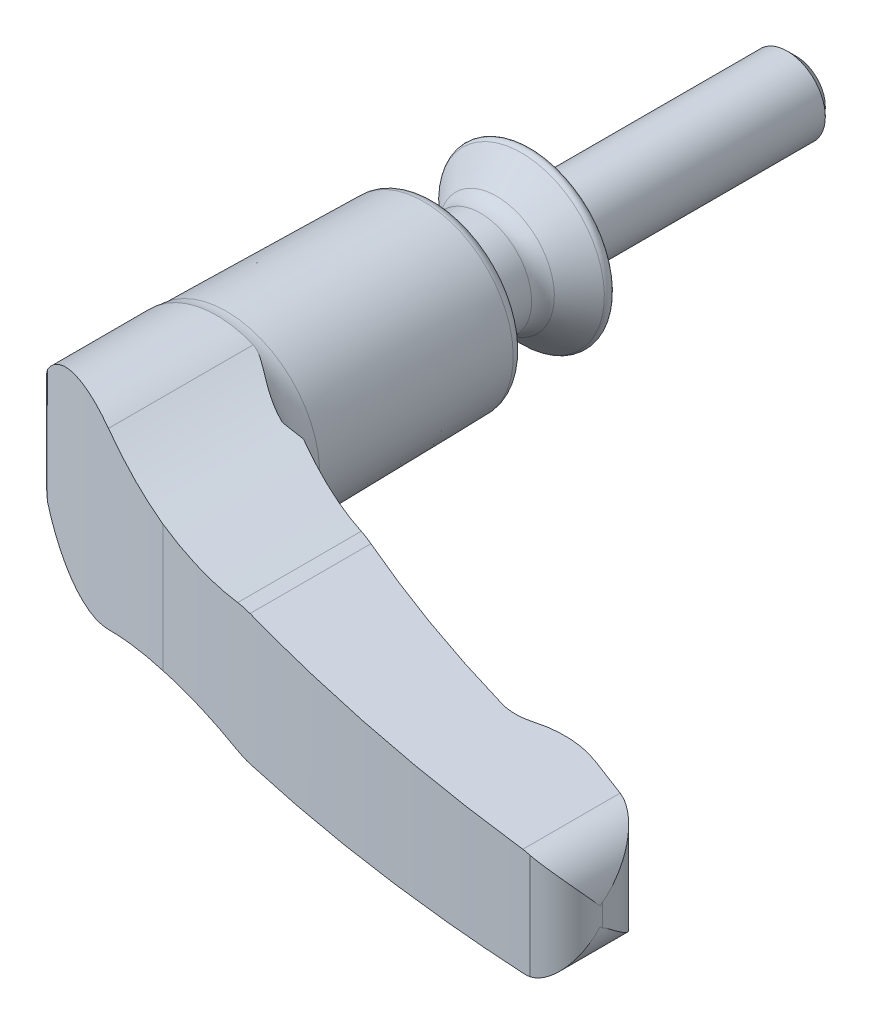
ISO-10303-21;
HEADER;
FILE_DESCRIPTION(('STEP AP214'),'2;1');
FILE_NAME('part.step','',(''),(''),'','','');
FILE_SCHEMA(('AUTOMOTIVE_DESIGN { 1 0 10303 214 1 1 1 1 }'));
ENDSEC;
DATA;
#1=APPLICATION_CONTEXT('core data for automotive mechanical design processes');
#2=APPLICATION_PROTOCOL_DEFINITION('international standard','automotive_design',2000,#1);
#3=PRODUCT_CONTEXT('',#1,'mechanical');
#4=PRODUCT('Part','Part','',(#3));
#5=PRODUCT_RELATED_PRODUCT_CATEGORY('part','',(#4));
#6=PRODUCT_DEFINITION_FORMATION('','',#4);
#7=PRODUCT_DEFINITION_CONTEXT('part definition',#1,'design');
#8=PRODUCT_DEFINITION('design','',#6,#7);
#9=PRODUCT_DEFINITION_SHAPE('','',#8);
#10=(LENGTH_UNIT() NAMED_UNIT(*) SI_UNIT(.MILLI.,.METRE.));
#11=(NAMED_UNIT(*) PLANE_ANGLE_UNIT() SI_UNIT($,.RADIAN.));
#12=(NAMED_UNIT(*) SI_UNIT($,.STERADIAN.) SOLID_ANGLE_UNIT());
#13=UNCERTAINTY_MEASURE_WITH_UNIT(LENGTH_MEASURE(1.E-05),#10,'distance_accuracy_value','');
#14=(GEOMETRIC_REPRESENTATION_CONTEXT(3) GLOBAL_UNCERTAINTY_ASSIGNED_CONTEXT((#13)) GLOBAL_UNIT_ASSIGNED_CONTEXT((#10,
#11,#12)) REPRESENTATION_CONTEXT('',''));
#15=CARTESIAN_POINT('',(0.,0.,0.));
#16=DIRECTION('',(0.,0.,1.));
#17=DIRECTION('',(1.,0.,0.));
#18=AXIS2_PLACEMENT_3D('',#15,#16,#17);
#19=CARTESIAN_POINT('',(-12.2494442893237,-13.45,40.2250875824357));
#20=DIRECTION('',(0.,0.,1.));
#21=DIRECTION('',(-1.,0.,0.));
#22=AXIS2_PLACEMENT_3D('',#19,#20,#21);
#23=PLANE('',#22);
#24=DIRECTION('',(0.,1.,0.));
#25=VECTOR('',#24,1.);
#26=CARTESIAN_POINT('',(-12.2494442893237,-13.45,40.2250875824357));
#27=LINE('',#26,#25);
#28=CARTESIAN_POINT('',(-12.2494442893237,-1.12726551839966,40.2250875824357));
#29=VERTEX_POINT('',#28);
#30=CARTESIAN_POINT('',(-12.2494442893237,0.,40.2250875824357));
#31=VERTEX_POINT('',#30);
#32=EDGE_CURVE('E175',#29,#31,#27,.T.);
#33=ORIENTED_EDGE('',*,*,#32,.T.);
#34=CARTESIAN_POINT('',(-1.62642046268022E-13,0.,40.2250875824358));
#35=DIRECTION('',(0.,0.,1.));
#36=DIRECTION('',(-1.,0.,0.));
#37=AXIS2_PLACEMENT_3D('',#34,#35,#36);
#38=CIRCLE('',#37,12.2494442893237);
#39=EDGE_CURVE('E178',#31,#31,#38,.F.);
#40=ORIENTED_EDGE('',*,*,#39,.F.);
#41=CARTESIAN_POINT('',(-12.2494442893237,1.12726551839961,40.2250875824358));
#42=VERTEX_POINT('',#41);
#43=EDGE_CURVE('E185',#31,#42,#27,.T.);
#44=ORIENTED_EDGE('',*,*,#43,.T.);
#45=CARTESIAN_POINT('',(0.,0.,40.2250875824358));
#46=DIRECTION('',(0.,0.,-1.));
#47=DIRECTION('',(1.,0.,0.));
#48=AXIS2_PLACEMENT_3D('',#45,#46,#47);
#49=CIRCLE('',#48,12.3012037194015);
#50=EDGE_CURVE('E180',#42,#29,#49,.T.);
#51=ORIENTED_EDGE('',*,*,#50,.T.);
#52=EDGE_LOOP('',(#33,#40,#44,#51));
#53=FACE_BOUND('',#52,.T.);
#54=ADVANCED_FACE('F14',(#53),#23,.F.);
#55=CARTESIAN_POINT('',(-12.3990914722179,-13.45,48.8947231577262));
#56=DIRECTION('',(0.999851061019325,0.,0.0172584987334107));
#57=DIRECTION('',(-0.0172584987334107,0.,0.999851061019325));
#58=AXIS2_PLACEMENT_3D('',#55,#56,#57);
#59=PLANE('',#58);
#60=ORIENTED_EDGE('',*,*,#43,.F.);
#61=ORIENTED_EDGE('',*,*,#32,.F.);
#62=CARTESIAN_POINT('',(-12.2494408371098,-1.12726105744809,40.2248875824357));
#63=CARTESIAN_POINT('',(-12.2501546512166,-1.12801102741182,40.2662415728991));
#64=CARTESIAN_POINT('',(-12.2508608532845,-1.13338949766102,40.3071545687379));
#65=CARTESIAN_POINT('',(-12.2522296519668,-1.15131266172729,40.3864543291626));
#66=CARTESIAN_POINT('',(-12.2528928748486,-1.16369170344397,40.4248773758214));
#67=CARTESIAN_POINT('',(-12.254538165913,-1.20206398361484,40.520195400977));
#68=CARTESIAN_POINT('',(-12.255493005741,-1.23180007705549,40.575512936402));
#69=CARTESIAN_POINT('',(-12.257344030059,-1.29909643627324,40.6827498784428));
#70=CARTESIAN_POINT('',(-12.2582382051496,-1.33683049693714,40.7345528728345));
#71=CARTESIAN_POINT('',(-12.2604895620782,-1.44052319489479,40.8649826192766));
#72=CARTESIAN_POINT('',(-12.2618006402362,-1.50977612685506,40.9409384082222));
#73=CARTESIAN_POINT('',(-12.264338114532,-1.65349391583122,41.0879440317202));
#74=CARTESIAN_POINT('',(-12.2655642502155,-1.72797350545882,41.1589787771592));
#75=CARTESIAN_POINT('',(-12.2678450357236,-1.87254522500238,41.2911134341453));
#76=CARTESIAN_POINT('',(-12.268904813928,-1.94236687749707,41.3525104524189));
#77=CARTESIAN_POINT('',(-12.2709847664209,-2.08326818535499,41.4730100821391));
#78=CARTESIAN_POINT('',(-12.2720051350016,-2.15433817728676,41.5321239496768));
#79=CARTESIAN_POINT('',(-12.2730148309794,-2.22587171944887,41.5906195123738));
#80=B_SPLINE_CURVE_WITH_KNOTS('',3,(#62,#63,#64,#65,#66,#67,#68,#69,#70,#71,#72,#73,#74,#75,#76,
#77,#78,#79),.UNSPECIFIED.,.F.,.F.,(4,2,2,2,2,2,2,2,4),(0.,0.123330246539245,0.243857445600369,
0.431247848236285,0.623227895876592,0.931023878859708,1.23972530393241,1.51862793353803,
1.79591047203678),.UNSPECIFIED.);
#81=CARTESIAN_POINT('',(-12.271249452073,-2.10212675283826,41.4883443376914));
#82=VERTEX_POINT('',#81);
#83=EDGE_CURVE('E399',#29,#82,#80,.T.);
#84=ORIENTED_EDGE('',*,*,#83,.T.);
#85=CARTESIAN_POINT('',(0.,0.,-669.432227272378));
#86=DIRECTION('',(0.999851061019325,0.,0.0172584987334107));
#87=DIRECTION('',(0.0172584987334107,0.,-0.999851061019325));
#88=AXIS2_PLACEMENT_3D('',#85,#86,#87);
#89=ELLIPSE('',#88,721.383718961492,12.45);
#90=CARTESIAN_POINT('',(-12.3990914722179,-1.12473581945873,48.8947231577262));
#91=VERTEX_POINT('',#90);
#92=EDGE_CURVE('E239',#82,#91,#89,.F.);
#93=ORIENTED_EDGE('',*,*,#92,.T.);
#94=DIRECTION('',(0.,1.,0.));
#95=VECTOR('',#94,1.);
#96=CARTESIAN_POINT('',(-12.3990914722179,-13.45,48.8947231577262));
#97=LINE('',#96,#95);
#98=CARTESIAN_POINT('',(-12.3990914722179,1.12473581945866,48.8947231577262));
#99=VERTEX_POINT('',#98);
#100=EDGE_CURVE('E184',#91,#99,#97,.T.);
#101=ORIENTED_EDGE('',*,*,#100,.T.);
#102=CARTESIAN_POINT('',(0.,0.,-669.432227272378));
#103=DIRECTION('',(0.999851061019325,0.,0.0172584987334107));
#104=DIRECTION('',(0.0172584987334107,0.,-0.999851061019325));
#105=AXIS2_PLACEMENT_3D('',#102,#103,#104);
#106=ELLIPSE('',#105,721.383718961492,12.45);
#107=CARTESIAN_POINT('',(-12.271249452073,2.10212675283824,41.4883443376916));
#108=VERTEX_POINT('',#107);
#109=EDGE_CURVE('E263',#99,#108,#106,.F.);
#110=ORIENTED_EDGE('',*,*,#109,.T.);
#111=CARTESIAN_POINT('',(-12.2730148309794,2.2258717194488,41.5906195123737));
#112=CARTESIAN_POINT('',(-12.2723484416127,2.17857656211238,41.5520130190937));
#113=CARTESIAN_POINT('',(-12.2716768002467,2.13153645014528,41.5131022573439));
#114=CARTESIAN_POINT('',(-12.2703199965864,2.03804940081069,41.4344974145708));
#115=CARTESIAN_POINT('',(-12.269634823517,1.99160298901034,41.3948027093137));
#116=CARTESIAN_POINT('',(-12.2675030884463,1.84986894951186,41.2713031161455));
#117=CARTESIAN_POINT('',(-12.2660309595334,1.75583214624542,41.1860170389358));
#118=CARTESIAN_POINT('',(-12.2637374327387,1.61936868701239,41.0531442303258));
#119=CARTESIAN_POINT('',(-12.2629577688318,1.574598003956,41.0079753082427));
#120=CARTESIAN_POINT('',(-12.2613598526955,1.48744881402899,40.9154018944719));
#121=CARTESIAN_POINT('',(-12.2605416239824,1.44506888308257,40.8679987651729));
#122=CARTESIAN_POINT('',(-12.2588634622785,1.36463549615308,40.7707764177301));
#123=CARTESIAN_POINT('',(-12.2580043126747,1.32652790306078,40.7210025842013));
#124=CARTESIAN_POINT('',(-12.2562147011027,1.25655247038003,40.6173235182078));
#125=CARTESIAN_POINT('',(-12.2552845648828,1.22465826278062,40.5634371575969));
#126=CARTESIAN_POINT('',(-12.2536883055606,1.18138793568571,40.4709597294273));
#127=CARTESIAN_POINT('',(-12.2530490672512,1.16676743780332,40.4339262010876));
#128=CARTESIAN_POINT('',(-12.2517389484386,1.14385333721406,40.3580259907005));
#129=CARTESIAN_POINT('',(-12.251068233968,1.13552979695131,40.3191689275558));
#130=CARTESIAN_POINT('',(-12.2500751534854,1.12891545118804,40.2616359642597));
#131=CARTESIAN_POINT('',(-12.2497582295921,1.12764004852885,40.2432753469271));
#132=CARTESIAN_POINT('',(-12.2494408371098,1.12726105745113,40.2248875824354));
#133=B_SPLINE_CURVE_WITH_KNOTS('',3,(#111,#112,#113,#114,#115,#116,#117,#118,#119,#120,#121,
#122,#123,#124,#125,#126,#127,#128,#129,#130,#131,#132),.UNSPECIFIED.,.F.,.F.,(4,2,2,2,2,2,2,2,
2,2,4),(0.,0.183152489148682,0.366457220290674,0.747103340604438,0.937859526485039,
1.12850085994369,1.31635856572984,1.50340080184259,1.62247471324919,1.74097889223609,
1.79613687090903),.UNSPECIFIED.);
#134=EDGE_CURVE('E190',#108,#42,#133,.T.);
#135=ORIENTED_EDGE('',*,*,#134,.T.);
#136=EDGE_LOOP('',(#60,#61,#84,#93,#101,#110,#135));
#137=FACE_BOUND('',#136,.T.);
#138=ADVANCED_FACE('F188',(#137),#59,.F.);
#139=CARTESIAN_POINT('',(111.767919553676,-13.45,-139.797819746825));
#140=DIRECTION('',(0.,1.,0.));
#141=DIRECTION('',(-1.,0.,0.));
#142=AXIS2_PLACEMENT_3D('',#139,#140,#141);
#143=CYLINDRICAL_SURFACE('',#142,208.999999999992);
#144=DIRECTION('',(0.,1.,0.));
#145=VECTOR('',#144,1.);
#146=CARTESIAN_POINT('',(15.7999999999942,-13.45,45.8662812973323));
#147=LINE('',#146,#145);
#148=CARTESIAN_POINT('',(15.8,-8.43613014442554,45.8662812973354));
#149=VERTEX_POINT('',#148);
#150=CARTESIAN_POINT('',(15.8,0.,45.8662812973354));
#151=VERTEX_POINT('',#150);
#152=EDGE_CURVE('E191',#149,#151,#147,.T.);
#153=ORIENTED_EDGE('',*,*,#152,.T.);
#154=DIRECTION('',(0.,1.,0.));
#155=VECTOR('',#154,1.);
#156=CARTESIAN_POINT('',(15.8,-13.45,45.8662812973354));
#157=LINE('',#156,#155);
#158=CARTESIAN_POINT('',(15.7999999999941,8.43613014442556,45.8662812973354));
#159=VERTEX_POINT('',#158);
#160=EDGE_CURVE('E413',#159,#151,#157,.F.);
#161=ORIENTED_EDGE('',*,*,#160,.F.);
#162=CARTESIAN_POINT('',(15.7999999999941,8.43613014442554,45.8662812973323));
#163=CARTESIAN_POINT('',(16.3870365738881,8.34717375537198,46.1697176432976));
#164=CARTESIAN_POINT('',(16.9767713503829,8.26904045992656,46.4710139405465));
#165=CARTESIAN_POINT('',(18.161091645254,8.13475115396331,47.0689822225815));
#166=CARTESIAN_POINT('',(18.7556773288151,8.07859589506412,47.3656540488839));
#167=CARTESIAN_POINT('',(20.5395968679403,7.94407204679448,48.2451118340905));
#168=CARTESIAN_POINT('',(21.7352391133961,7.89871013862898,48.8205177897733));
#169=CARTESIAN_POINT('',(24.1374209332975,7.89893976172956,49.9484747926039));
#170=CARTESIAN_POINT('',(25.3439611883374,7.94453701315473,50.5010244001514));
#171=CARTESIAN_POINT('',(27.1599173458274,8.0830634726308,51.3119106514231));
#172=CARTESIAN_POINT('',(27.7678474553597,8.14117035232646,51.5798888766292));
#173=CARTESIAN_POINT('',(28.9839481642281,8.28117670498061,52.1090693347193));
#174=CARTESIAN_POINT('',(29.5921187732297,8.36307725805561,52.370271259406));
#175=CARTESIAN_POINT('',(30.2000000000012,8.45699782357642,52.6279438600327));
#176=B_SPLINE_CURVE_WITH_KNOTS('',3,(#162,#163,#164,#165,#166,#167,#168,#169,#170,#171,#172,
#173,#174,#175),.UNSPECIFIED.,.F.,.F.,(4,2,2,2,2,2,4),(0.,2.00016069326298,4.00038978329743,
7.97994863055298,11.9597577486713,13.9600808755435,15.9604948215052),.UNSPECIFIED.);
#177=CARTESIAN_POINT('',(30.2000000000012,8.45699782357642,52.6279438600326));
#178=VERTEX_POINT('',#177);
#179=EDGE_CURVE('E264',#159,#178,#176,.T.);
#180=ORIENTED_EDGE('',*,*,#179,.T.);
#181=CARTESIAN_POINT('',(32.4002231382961,8.59297245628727,53.5458348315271));
#182=CARTESIAN_POINT('',(32.2157966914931,8.59945246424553,53.4701291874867));
#183=CARTESIAN_POINT('',(32.0313583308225,8.60144694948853,53.3941076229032));
#184=CARTESIAN_POINT('',(31.6631700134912,8.59650662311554,53.2417318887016));
#185=CARTESIAN_POINT('',(31.4794194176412,8.58958963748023,53.1653786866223));
#186=CARTESIAN_POINT('',(30.9288846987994,8.55552869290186,52.9356990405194));
#187=CARTESIAN_POINT('',(30.5630943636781,8.51506518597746,52.7818661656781));
#188=CARTESIAN_POINT('',(30.2000000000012,8.45699782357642,52.6279438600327));
#189=B_SPLINE_CURVE_WITH_KNOTS('',3,(#181,#182,#183,#184,#185,#186,#187,#188),.UNSPECIFIED.,.F.,
.F.,(4,2,2,4),(0.,0.598316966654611,1.19543895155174,2.3905773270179),.UNSPECIFIED.);
#190=CARTESIAN_POINT('',(32.4002231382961,8.59297245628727,53.5458348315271));
#191=VERTEX_POINT('',#190);
#192=EDGE_CURVE('E342',#191,#178,#189,.T.);
#193=ORIENTED_EDGE('',*,*,#192,.F.);
#194=CARTESIAN_POINT('',(111.767919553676,5.80486876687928,-139.797819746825));
#195=DIRECTION('',(-0.0351072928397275,-0.999383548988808,0.));
#196=DIRECTION('',(-0.999383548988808,0.0351072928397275,0.));
#197=AXIS2_PLACEMENT_3D('',#194,#195,#196);
#198=ELLIPSE('',#197,209.128917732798,208.999999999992);
#199=CARTESIAN_POINT('',(58.4999999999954,7.67611474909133,62.2999999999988));
#200=VERTEX_POINT('',#199);
#201=EDGE_CURVE('E350',#200,#191,#198,.T.);
#202=ORIENTED_EDGE('',*,*,#201,.F.);
#203=DIRECTION('',(0.,1.,0.));
#204=VECTOR('',#203,1.);
#205=CARTESIAN_POINT('',(58.4999999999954,-13.45,62.2999999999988));
#206=LINE('',#205,#204);
#207=CARTESIAN_POINT('',(58.4999999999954,-7.67611474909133,62.2999999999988));
#208=VERTEX_POINT('',#207);
#209=EDGE_CURVE('E193',#208,#200,#206,.T.);
#210=ORIENTED_EDGE('',*,*,#209,.F.);
#211=CARTESIAN_POINT('',(111.767919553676,-5.80486876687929,-139.797819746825));
#212=DIRECTION('',(-0.0351072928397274,0.999383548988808,0.));
#213=DIRECTION('',(0.999383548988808,0.0351072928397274,0.));
#214=AXIS2_PLACEMENT_3D('',#211,#212,#213);
#215=ELLIPSE('',#214,209.128917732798,208.999999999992);
#216=CARTESIAN_POINT('',(32.4002231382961,-8.59297245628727,53.5458348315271));
#217=VERTEX_POINT('',#216);
#218=EDGE_CURVE('E817',#217,#208,#215,.T.);
#219=ORIENTED_EDGE('',*,*,#218,.F.);
#220=CARTESIAN_POINT('',(30.2000000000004,-8.45699782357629,52.6279438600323));
#221=CARTESIAN_POINT('',(30.5630943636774,-8.51506518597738,52.7818661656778));
#222=CARTESIAN_POINT('',(30.9288846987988,-8.55552869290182,52.9356990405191));
#223=CARTESIAN_POINT('',(31.4794194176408,-8.58958963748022,53.1653786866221));
#224=CARTESIAN_POINT('',(31.6631700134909,-8.59650662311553,53.2417318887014));
#225=CARTESIAN_POINT('',(32.0313583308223,-8.60144694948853,53.3941076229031));
#226=CARTESIAN_POINT('',(32.215796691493,-8.59945246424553,53.4701291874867));
#227=CARTESIAN_POINT('',(32.4002231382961,-8.59297245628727,53.5458348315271));
#228=B_SPLINE_CURVE_WITH_KNOTS('',3,(#220,#221,#222,#223,#224,#225,#226,#227),.UNSPECIFIED.,.F.,
.F.,(4,2,2,4),(0.,1.19513837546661,1.79226036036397,2.39057732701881),.UNSPECIFIED.);
#229=CARTESIAN_POINT('',(30.2000000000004,-8.45699782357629,52.6279438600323));
#230=VERTEX_POINT('',#229);
#231=EDGE_CURVE('E317',#230,#217,#228,.T.);
#232=ORIENTED_EDGE('',*,*,#231,.F.);
#233=CARTESIAN_POINT('',(30.2,-8.45699782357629,52.6279438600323));
#234=CARTESIAN_POINT('',(29.5921187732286,-8.36307725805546,52.3702712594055));
#235=CARTESIAN_POINT('',(28.983948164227,-8.28117670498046,52.1090693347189));
#236=CARTESIAN_POINT('',(27.7678474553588,-8.14117035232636,51.5798888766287));
#237=CARTESIAN_POINT('',(27.1599173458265,-8.08306347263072,51.3119106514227));
#238=CARTESIAN_POINT('',(25.3439611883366,-7.94453701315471,50.5010244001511));
#239=CARTESIAN_POINT('',(24.1374209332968,-7.89893976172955,49.9484747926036));
#240=CARTESIAN_POINT('',(21.7352391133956,-7.89871013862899,48.820517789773));
#241=CARTESIAN_POINT('',(20.5395968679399,-7.9440720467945,48.2451118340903));
#242=CARTESIAN_POINT('',(18.7556773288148,-8.07859589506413,47.3656540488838));
#243=CARTESIAN_POINT('',(18.1610916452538,-8.13475115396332,47.0689822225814));
#244=CARTESIAN_POINT('',(16.9767713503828,-8.26904045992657,46.4710139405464));
#245=CARTESIAN_POINT('',(16.387036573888,-8.34717375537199,46.1697176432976));
#246=CARTESIAN_POINT('',(15.7999999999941,-8.43613014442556,45.8662812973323));
#247=B_SPLINE_CURVE_WITH_KNOTS('',3,(#233,#234,#235,#236,#237,#238,#239,#240,#241,#242,#243,
#244,#245,#246),.UNSPECIFIED.,.F.,.F.,(4,2,2,2,2,2,4),(0.,2.00041394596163,4.00073707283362,
7.98054619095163,11.9601050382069,13.9603341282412,15.960494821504),.UNSPECIFIED.);
#248=EDGE_CURVE('E335',#230,#149,#247,.T.);
#249=ORIENTED_EDGE('',*,*,#248,.T.);
#250=EDGE_LOOP('',(#153,#161,#180,#193,#202,#210,#219,#232,#249));
#251=FACE_BOUND('',#250,.T.);
#252=ADVANCED_FACE('F325',(#251),#143,.F.);
#253=CARTESIAN_POINT('',(76.9,-13.45,77.));
#254=DIRECTION('',(0.,0.,-1.));
#255=DIRECTION('',(0.,1.,0.));
#256=AXIS2_PLACEMENT_3D('',#253,#254,#255);
#257=PLANE('',#256);
#258=DIRECTION('',(0.,1.,0.));
#259=VECTOR('',#258,1.);
#260=CARTESIAN_POINT('',(76.9,-13.45,77.));
#261=LINE('',#260,#259);
#262=CARTESIAN_POINT('',(76.9,-6.92676825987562,77.));
#263=VERTEX_POINT('',#262);
#264=CARTESIAN_POINT('',(76.9,6.92676825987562,77.));
#265=VERTEX_POINT('',#264);
#266=EDGE_CURVE('E790',#263,#265,#261,.T.);
#267=ORIENTED_EDGE('',*,*,#266,.T.);
#268=CARTESIAN_POINT('',(75.6,1.17177043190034,77.));
#269=DIRECTION('',(0.,0.,-1.));
#270=DIRECTION('',(0.,1.,0.));
#271=AXIS2_PLACEMENT_3D('',#268,#269,#270);
#272=CIRCLE('',#271,5.9);
#273=CARTESIAN_POINT('',(76.8,6.94844767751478,77.));
#274=VERTEX_POINT('',#273);
#275=EDGE_CURVE('E860',#265,#274,#272,.F.);
#276=ORIENTED_EDGE('',*,*,#275,.T.);
#277=DIRECTION('',(0.,1.,0.));
#278=VECTOR('',#277,1.);
#279=CARTESIAN_POINT('',(76.8,-13.45,77.));
#280=LINE('',#279,#278);
#281=CARTESIAN_POINT('',(76.8,-6.94844767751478,77.));
#282=VERTEX_POINT('',#281);
#283=EDGE_CURVE('E788',#282,#274,#280,.T.);
#284=ORIENTED_EDGE('',*,*,#283,.F.);
#285=CARTESIAN_POINT('',(75.6,-1.17177043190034,77.));
#286=DIRECTION('',(0.,0.,-1.));
#287=DIRECTION('',(0.,1.,0.));
#288=AXIS2_PLACEMENT_3D('',#285,#286,#287);
#289=CIRCLE('',#288,5.9);
#290=EDGE_CURVE('E903',#282,#263,#289,.F.);
#291=ORIENTED_EDGE('',*,*,#290,.T.);
#292=EDGE_LOOP('',(#267,#276,#284,#291));
#293=FACE_BOUND('',#292,.T.);
#294=ADVANCED_FACE('F329',(#293),#257,.F.);
#295=CARTESIAN_POINT('',(99.3774025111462,-13.45,-191.753327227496));
#296=DIRECTION('',(0.,1.,0.));
#297=DIRECTION('',(-1.,0.,0.));
#298=AXIS2_PLACEMENT_3D('',#295,#296,#297);
#299=CYLINDRICAL_SURFACE('',#298,269.7);
#300=CARTESIAN_POINT('',(16.1999999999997,8.37725139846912,64.8));
#301=CARTESIAN_POINT('',(16.7767031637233,8.29486390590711,64.9869756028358));
#302=CARTESIAN_POINT('',(17.3553557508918,8.22300064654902,65.1724296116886));
#303=CARTESIAN_POINT('',(18.5159500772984,8.10050516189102,65.5400576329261));
#304=CARTESIAN_POINT('',(19.0978918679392,8.04987326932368,65.7222315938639));
#305=CARTESIAN_POINT('',(20.8414876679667,7.93052773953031,66.2615450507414));
#306=CARTESIAN_POINT('',(22.0070770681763,7.89348273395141,66.6134754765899));
#307=CARTESIAN_POINT('',(24.3425845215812,7.90540743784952,67.3013928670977));
#308=CARTESIAN_POINT('',(25.512502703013,7.95437971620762,67.6373793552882));
#309=CARTESIAN_POINT('',(27.2687809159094,8.09314767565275,68.1289718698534));
#310=CARTESIAN_POINT('',(27.8560018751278,8.15052863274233,68.2911856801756));
#311=CARTESIAN_POINT('',(29.0291528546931,8.28726693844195,68.611001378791));
#312=CARTESIAN_POINT('',(29.6150828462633,8.36662477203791,68.7686031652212));
#313=CARTESIAN_POINT('',(30.2000000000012,8.45699782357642,68.9238236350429));
#314=B_SPLINE_CURVE_WITH_KNOTS('',3,(#300,#301,#302,#303,#304,#305,#306,#307,#308,#309,#310,
#311,#312,#313),.UNSPECIFIED.,.F.,.F.,(4,2,2,2,2,2,4),(0.,1.83529834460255,3.6706254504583,
7.32170279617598,10.9728891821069,12.808257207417,14.6436657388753),.UNSPECIFIED.);
#315=CARTESIAN_POINT('',(16.1999999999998,8.37725139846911,64.8));
#316=VERTEX_POINT('',#315);
#317=CARTESIAN_POINT('',(30.2000000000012,8.45699782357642,68.9238236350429));
#318=VERTEX_POINT('',#317);
#319=EDGE_CURVE('E775',#316,#318,#314,.T.);
#320=ORIENTED_EDGE('',*,*,#319,.F.);
#321=DIRECTION('',(0.,1.,0.));
#322=VECTOR('',#321,1.);
#323=CARTESIAN_POINT('',(16.1999999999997,-13.45,64.8));
#324=LINE('',#323,#322);
#325=CARTESIAN_POINT('',(16.1999999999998,-8.37725139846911,64.8));
#326=VERTEX_POINT('',#325);
#327=EDGE_CURVE('E349',#326,#316,#324,.T.);
#328=ORIENTED_EDGE('',*,*,#327,.F.);
#329=CARTESIAN_POINT('',(30.2,-8.45699782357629,68.9238236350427));
#330=CARTESIAN_POINT('',(29.6150828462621,-8.36662477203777,68.7686031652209));
#331=CARTESIAN_POINT('',(29.029152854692,-8.28726693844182,68.6110013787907));
#332=CARTESIAN_POINT('',(27.8560018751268,-8.15052863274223,68.2911856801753));
#333=CARTESIAN_POINT('',(27.2687809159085,-8.09314767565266,68.1289718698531));
#334=CARTESIAN_POINT('',(25.5125027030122,-7.95437971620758,67.637379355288));
#335=CARTESIAN_POINT('',(24.3425845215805,-7.9054074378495,67.3013928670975));
#336=CARTESIAN_POINT('',(22.0070770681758,-7.89348273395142,66.6134754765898));
#337=CARTESIAN_POINT('',(20.8414876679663,-7.93052773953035,66.2615450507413));
#338=CARTESIAN_POINT('',(19.097891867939,-8.0498732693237,65.7222315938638));
#339=CARTESIAN_POINT('',(18.5159500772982,-8.10050516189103,65.540057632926));
#340=CARTESIAN_POINT('',(17.3553557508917,-8.22300064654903,65.1724296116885));
#341=CARTESIAN_POINT('',(16.7767031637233,-8.29486390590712,64.9869756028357));
#342=CARTESIAN_POINT('',(16.1999999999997,-8.37725139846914,64.8));
#343=B_SPLINE_CURVE_WITH_KNOTS('',3,(#329,#330,#331,#332,#333,#334,#335,#336,#337,#338,#339,
#340,#341,#342),.UNSPECIFIED.,.F.,.F.,(4,2,2,2,2,2,4),(0.,1.83540853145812,3.67077655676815,
7.32196294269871,10.9730402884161,12.8083673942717,14.6436657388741),.UNSPECIFIED.);
#344=CARTESIAN_POINT('',(30.2000000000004,-8.45699782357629,68.9238236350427));
#345=VERTEX_POINT('',#344);
#346=EDGE_CURVE('E446',#345,#326,#343,.T.);
#347=ORIENTED_EDGE('',*,*,#346,.F.);
#348=CARTESIAN_POINT('',(30.2000000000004,-8.45699782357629,68.9238236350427));
#349=CARTESIAN_POINT('',(30.5632894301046,-8.51510955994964,69.0202386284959));
#350=CARTESIAN_POINT('',(30.9292671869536,-8.55556829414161,69.1165394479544));
#351=CARTESIAN_POINT('',(31.4798508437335,-8.58960835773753,69.2601745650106));
#352=CARTESIAN_POINT('',(31.6635722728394,-8.5965163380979,69.3078974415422));
#353=CARTESIAN_POINT('',(32.0316308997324,-8.60144626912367,69.4030885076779));
#354=CARTESIAN_POINT('',(32.21596856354,-8.59944866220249,69.4505559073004));
#355=CARTESIAN_POINT('',(32.4002231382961,-8.59297245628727,69.4977922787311));
#356=B_SPLINE_CURVE_WITH_KNOTS('',3,(#348,#349,#350,#351,#352,#353,#354,#355),.UNSPECIFIED.,.F.,
.F.,(4,2,2,4),(0.,1.14021168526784,1.70984874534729,2.2807374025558),.UNSPECIFIED.);
#357=CARTESIAN_POINT('',(32.4002231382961,-8.59297245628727,69.497792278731));
#358=VERTEX_POINT('',#357);
#359=EDGE_CURVE('E292',#345,#358,#356,.T.);
#360=ORIENTED_EDGE('',*,*,#359,.T.);
#361=CARTESIAN_POINT('',(99.3774025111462,-6.24013459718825,-191.753327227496));
#362=DIRECTION('',(-0.0351072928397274,0.999383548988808,0.));
#363=DIRECTION('',(0.999383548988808,0.0351072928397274,0.));
#364=AXIS2_PLACEMENT_3D('',#361,#362,#363);
#365=ELLIPSE('',#364,269.866359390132,269.7);
#366=CARTESIAN_POINT('',(75.8071330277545,-7.06813337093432,76.9147438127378));
#367=VERTEX_POINT('',#366);
#368=EDGE_CURVE('E304',#358,#367,#365,.T.);
#369=ORIENTED_EDGE('',*,*,#368,.T.);
#370=CARTESIAN_POINT('',(75.8071330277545,-7.06813337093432,76.9147438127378));
#371=CARTESIAN_POINT('',(75.9742663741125,-7.06223993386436,76.929403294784));
#372=CARTESIAN_POINT('',(76.1405719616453,-7.04931940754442,76.943837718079));
#373=CARTESIAN_POINT('',(76.4715276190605,-7.00942417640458,76.9722564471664));
#374=CARTESIAN_POINT('',(76.6361776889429,-6.98244947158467,76.9862407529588));
#375=CARTESIAN_POINT('',(76.8,-6.94844767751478,77.));
#376=B_SPLINE_CURVE_WITH_KNOTS('',3,(#370,#371,#372,#373,#374,#375),.UNSPECIFIED.,.F.,.F.,(4,2,
4),(0.,0.50229032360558,1.00458064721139),.UNSPECIFIED.);
#377=EDGE_CURVE('E905',#367,#282,#376,.T.);
#378=ORIENTED_EDGE('',*,*,#377,.T.);
#379=ORIENTED_EDGE('',*,*,#283,.T.);
#380=CARTESIAN_POINT('',(76.8,6.94844767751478,77.));
#381=CARTESIAN_POINT('',(76.6361776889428,6.98244947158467,76.9862407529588));
#382=CARTESIAN_POINT('',(76.4715276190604,7.00942417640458,76.9722564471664));
#383=CARTESIAN_POINT('',(76.1405719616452,7.04931940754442,76.943837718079));
#384=CARTESIAN_POINT('',(75.9742663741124,7.06223993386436,76.929403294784));
#385=CARTESIAN_POINT('',(75.8071330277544,7.06813337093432,76.9147438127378));
#386=B_SPLINE_CURVE_WITH_KNOTS('',3,(#380,#381,#382,#383,#384,#385),.UNSPECIFIED.,.F.,.F.,(4,2,
4),(0.,0.502290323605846,1.00458064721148),.UNSPECIFIED.);
#387=CARTESIAN_POINT('',(75.8071330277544,7.06813337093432,76.9147438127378));
#388=VERTEX_POINT('',#387);
#389=EDGE_CURVE('E847',#274,#388,#386,.T.);
#390=ORIENTED_EDGE('',*,*,#389,.T.);
#391=CARTESIAN_POINT('',(99.3774025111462,6.24013459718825,-191.753327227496));
#392=DIRECTION('',(-0.0351072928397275,-0.999383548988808,0.));
#393=DIRECTION('',(-0.999383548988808,0.0351072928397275,0.));
#394=AXIS2_PLACEMENT_3D('',#391,#392,#393);
#395=ELLIPSE('',#394,269.866359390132,269.7);
#396=CARTESIAN_POINT('',(32.4002231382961,8.59297245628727,69.497792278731));
#397=VERTEX_POINT('',#396);
#398=EDGE_CURVE('E372',#388,#397,#395,.T.);
#399=ORIENTED_EDGE('',*,*,#398,.T.);
#400=CARTESIAN_POINT('',(32.4002231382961,8.59297245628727,69.497792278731));
#401=CARTESIAN_POINT('',(32.2159685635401,8.59944866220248,69.4505559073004));
#402=CARTESIAN_POINT('',(32.0316308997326,8.60144626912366,69.4030885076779));
#403=CARTESIAN_POINT('',(31.6635722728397,8.5965163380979,69.3078974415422));
#404=CARTESIAN_POINT('',(31.4798508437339,8.58960835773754,69.2601745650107));
#405=CARTESIAN_POINT('',(30.9292671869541,8.55556829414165,69.1165394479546));
#406=CARTESIAN_POINT('',(30.5632894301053,8.51510955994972,69.0202386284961));
#407=CARTESIAN_POINT('',(30.2000000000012,8.45699782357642,68.9238236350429));
#408=B_SPLINE_CURVE_WITH_KNOTS('',3,(#400,#401,#402,#403,#404,#405,#406,#407),.UNSPECIFIED.,.F.,
.F.,(4,2,2,4),(0.,0.5708886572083,1.14052571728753,2.28073740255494),.UNSPECIFIED.);
#409=EDGE_CURVE('E363',#397,#318,#408,.T.);
#410=ORIENTED_EDGE('',*,*,#409,.T.);
#411=EDGE_LOOP('',(#320,#328,#347,#360,#369,#378,#379,#390,#399,#410));
#412=FACE_BOUND('',#411,.T.);
#413=ADVANCED_FACE('F306',(#412),#299,.T.);
#414=CARTESIAN_POINT('',(79.8840849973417,-13.45,-124.78991881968));
#415=DIRECTION('',(0.,1.,0.));
#416=DIRECTION('',(-1.,0.,0.));
#417=AXIS2_PLACEMENT_3D('',#414,#415,#416);
#418=CYLINDRICAL_SURFACE('',#417,200.000000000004);
#419=DIRECTION('',(0.,1.,0.));
#420=VECTOR('',#419,1.);
#421=CARTESIAN_POINT('',(-9.90000000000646,-13.45,53.9244289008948));
#422=LINE('',#421,#420);
#423=CARTESIAN_POINT('',(-9.90000000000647,-7.54933771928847,53.9244289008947));
#424=VERTEX_POINT('',#423);
#425=CARTESIAN_POINT('',(-9.90000000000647,7.54933771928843,53.9244289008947));
#426=VERTEX_POINT('',#425);
#427=EDGE_CURVE('E199',#424,#426,#422,.T.);
#428=ORIENTED_EDGE('',*,*,#427,.F.);
#429=CARTESIAN_POINT('',(-9.90000000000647,-7.54933771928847,53.9244289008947));
#430=CARTESIAN_POINT('',(-9.67451817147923,-7.84507120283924,54.0377127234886));
#431=CARTESIAN_POINT('',(-9.4368447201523,-8.12923310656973,54.1565790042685));
#432=CARTESIAN_POINT('',(-8.93966759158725,-8.67296304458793,54.403880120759));
#433=CARTESIAN_POINT('',(-8.68017587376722,-8.93254438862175,54.5323097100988));
#434=CARTESIAN_POINT('',(-8.14219185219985,-9.42550410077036,54.7970082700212));
#435=CARTESIAN_POINT('',(-7.86373776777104,-9.65893280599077,54.9332613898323));
#436=CARTESIAN_POINT('',(-7.28965149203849,-10.0992248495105,55.2124187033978));
#437=CARTESIAN_POINT('',(-6.994017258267,-10.3060850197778,55.3553236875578));
#438=CARTESIAN_POINT('',(-6.38843577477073,-10.6920089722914,55.6461218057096));
#439=CARTESIAN_POINT('',(-6.07851806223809,-10.8711270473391,55.7940044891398));
#440=CARTESIAN_POINT('',(-5.44596700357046,-11.2013953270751,56.0937585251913));
#441=CARTESIAN_POINT('',(-5.12333306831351,-11.3525442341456,56.2456300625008));
#442=CARTESIAN_POINT('',(-4.46756903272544,-11.6262415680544,56.5521043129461));
#443=CARTESIAN_POINT('',(-4.13444284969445,-11.7488005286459,56.7067059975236));
#444=CARTESIAN_POINT('',(-3.45976822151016,-11.9648655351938,57.0175072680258));
#445=CARTESIAN_POINT('',(-3.11822142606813,-12.0583772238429,57.1737065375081));
#446=CARTESIAN_POINT('',(-2.31903314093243,-12.2409805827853,57.5364253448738));
#447=CARTESIAN_POINT('',(-1.85895294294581,-12.3192478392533,57.743179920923));
#448=CARTESIAN_POINT('',(-1.16440659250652,-12.3976193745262,58.0521070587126));
#449=CARTESIAN_POINT('',(-0.932215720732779,-12.4172382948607,58.1548548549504));
#450=CARTESIAN_POINT('',(-0.466758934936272,-12.443430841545,58.3597645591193));
#451=CARTESIAN_POINT('',(-0.233492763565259,-12.4500011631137,58.4619263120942));
#452=CARTESIAN_POINT('',(0.405450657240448,-12.4499979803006,58.7403022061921));
#453=CARTESIAN_POINT('',(0.811584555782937,-12.4301810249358,58.9156432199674));
#454=CARTESIAN_POINT('',(1.62179032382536,-12.3506318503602,59.2622685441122));
#455=CARTESIAN_POINT('',(2.02586144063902,-12.2908859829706,59.4335514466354));
#456=CARTESIAN_POINT('',(2.83079805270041,-12.1308842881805,59.7716755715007));
#457=CARTESIAN_POINT('',(3.23162970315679,-12.030387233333,59.9384839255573));
#458=CARTESIAN_POINT('',(4.02384464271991,-11.7891025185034,60.2652335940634));
#459=CARTESIAN_POINT('',(4.41522782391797,-11.6483143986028,60.4251748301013));
#460=CARTESIAN_POINT('',(4.79999999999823,-11.4874931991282,60.5810071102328));
#461=B_SPLINE_CURVE_WITH_KNOTS('',3,(#429,#430,#431,#432,#433,#434,#435,#436,#437,#438,#439,
#440,#441,#442,#443,#444,#445,#446,#447,#448,#449,#450,#451,#452,#453,#454,#455,#456,#457,#458,
#459,#460),.UNSPECIFIED.,.F.,.F.,(4,2,2,2,2,2,2,2,2,2,2,2,2,2,2,4),(0.,1.16572536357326,
2.33081586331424,3.49362387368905,4.65657040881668,5.81721142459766,6.97790627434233,
8.1381727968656,9.29821378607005,10.8264676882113,11.5901890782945,12.3541038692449,
13.6806107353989,15.007571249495,16.3425041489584,17.67745228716),.UNSPECIFIED.);
#462=CARTESIAN_POINT('',(4.79999999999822,-11.4874931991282,60.5810071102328));
#463=VERTEX_POINT('',#462);
#464=EDGE_CURVE('E202',#424,#463,#461,.T.);
#465=ORIENTED_EDGE('',*,*,#464,.T.);
#466=CARTESIAN_POINT('',(16.1999999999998,-8.37725139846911,64.8));
#467=CARTESIAN_POINT('',(15.21368787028,-8.51813618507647,64.4687294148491));
#468=CARTESIAN_POINT('',(14.2339762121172,-8.68971619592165,64.1310391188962));
#469=CARTESIAN_POINT('',(12.2943158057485,-9.09213654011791,63.4457683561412));
#470=CARTESIAN_POINT('',(11.3343097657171,-9.32276678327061,63.0982267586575));
#471=CARTESIAN_POINT('',(9.43367460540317,-9.8421618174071,62.3938598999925));
#472=CARTESIAN_POINT('',(8.49304509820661,-10.1309254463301,62.0370348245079));
#473=CARTESIAN_POINT('',(6.63069309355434,-10.7662294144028,61.3147410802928));
#474=CARTESIAN_POINT('',(5.70904885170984,-11.1129696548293,60.9492463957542));
#475=CARTESIAN_POINT('',(4.79999999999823,-11.4874931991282,60.5810071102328));
#476=B_SPLINE_CURVE_WITH_KNOTS('',3,(#466,#467,#468,#469,#470,#471,#472,#473,#474,#475),
.UNSPECIFIED.,.F.,.F.,(4,2,2,2,4),(0.,3.14928931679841,6.2875260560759,9.42570006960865,
12.5749263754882),.UNSPECIFIED.);
#477=EDGE_CURVE('E211',#326,#463,#476,.T.);
#478=ORIENTED_EDGE('',*,*,#477,.F.);
#479=ORIENTED_EDGE('',*,*,#327,.T.);
#480=CARTESIAN_POINT('',(4.7999999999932,11.4874931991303,60.5810071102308));
#481=CARTESIAN_POINT('',(5.70904885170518,11.1129696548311,60.9492463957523));
#482=CARTESIAN_POINT('',(6.63069309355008,10.7662294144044,61.3147410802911));
#483=CARTESIAN_POINT('',(8.49304509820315,10.1309254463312,62.0370348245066));
#484=CARTESIAN_POINT('',(9.43367460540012,9.84216181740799,62.3938598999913));
#485=CARTESIAN_POINT('',(11.3343097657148,9.32276678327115,63.0982267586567));
#486=CARTESIAN_POINT('',(12.2943158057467,9.0921365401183,63.4457683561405));
#487=CARTESIAN_POINT('',(14.2339762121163,8.6897161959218,64.1310391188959));
#488=CARTESIAN_POINT('',(15.2136878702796,8.51813618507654,64.4687294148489));
#489=CARTESIAN_POINT('',(16.1999999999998,8.37725139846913,64.8));
#490=B_SPLINE_CURVE_WITH_KNOTS('',3,(#480,#481,#482,#483,#484,#485,#486,#487,#488,#489),
.UNSPECIFIED.,.F.,.F.,(4,2,2,2,4),(0.,3.14922630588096,6.28740031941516,9.42563705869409,
12.574926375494),.UNSPECIFIED.);
#491=CARTESIAN_POINT('',(4.7999999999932,11.4874931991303,60.5810071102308));
#492=VERTEX_POINT('',#491);
#493=EDGE_CURVE('E293',#492,#316,#490,.T.);
#494=ORIENTED_EDGE('',*,*,#493,.F.);
#495=CARTESIAN_POINT('',(4.79999999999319,11.4874931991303,60.5810071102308));
#496=CARTESIAN_POINT('',(4.41580947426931,11.6480694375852,60.425410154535));
#497=CARTESIAN_POINT('',(4.02503382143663,11.7886738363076,60.2657194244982));
#498=CARTESIAN_POINT('',(3.23419246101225,12.0296727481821,59.9395455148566));
#499=CARTESIAN_POINT('',(2.8341300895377,12.1300814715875,59.7730647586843));
#500=CARTESIAN_POINT('',(2.02936760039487,12.2903278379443,59.4350346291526));
#501=CARTESIAN_POINT('',(1.62468227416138,12.3502704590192,59.2634995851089));
#502=CARTESIAN_POINT('',(0.8131282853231,12.4301064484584,58.9163098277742));
#503=CARTESIAN_POINT('',(0.406259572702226,12.4499988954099,58.7406550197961));
#504=CARTESIAN_POINT('',(-0.381370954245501,12.4500010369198,58.3974981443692));
#505=CARTESIAN_POINT('',(-0.762205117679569,12.432473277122,58.230155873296));
#506=CARTESIAN_POINT('',(-1.52013839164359,12.3627058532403,57.8943010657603));
#507=CARTESIAN_POINT('',(-1.89723770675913,12.310468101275,57.7257885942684));
#508=CARTESIAN_POINT('',(-2.64540716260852,12.1716555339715,57.3887062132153));
#509=CARTESIAN_POINT('',(-3.0164722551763,12.0850533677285,57.2201363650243));
#510=CARTESIAN_POINT('',(-3.74968971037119,11.8780234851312,56.884389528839));
#511=CARTESIAN_POINT('',(-4.11184217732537,11.7575961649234,56.717212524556));
#512=CARTESIAN_POINT('',(-4.82530709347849,11.4832593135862,56.3853387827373));
#513=CARTESIAN_POINT('',(-5.17659902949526,11.329290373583,56.2206470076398));
#514=CARTESIAN_POINT('',(-5.86509267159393,10.9886630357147,55.8955080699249));
#515=CARTESIAN_POINT('',(-6.20229273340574,10.8020008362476,55.7350614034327));
#516=CARTESIAN_POINT('',(-6.85929279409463,10.3971732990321,55.4202886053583));
#517=CARTESIAN_POINT('',(-7.17912282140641,10.1790648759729,55.2659520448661));
#518=CARTESIAN_POINT('',(-7.79913838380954,9.71218172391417,54.9648338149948));
#519=CARTESIAN_POINT('',(-8.09933309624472,9.46342148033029,54.8180486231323));
#520=CARTESIAN_POINT('',(-8.6621015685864,8.9502892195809,54.5412436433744));
#521=CARTESIAN_POINT('',(-8.92582503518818,8.6874365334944,54.410747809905));
#522=CARTESIAN_POINT('',(-9.43052390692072,8.13678568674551,54.1597401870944));
#523=CARTESIAN_POINT('',(-9.67151657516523,7.8490067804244,54.03922082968));
#524=CARTESIAN_POINT('',(-9.90000000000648,7.54933771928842,53.9244289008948));
#525=B_SPLINE_CURVE_WITH_KNOTS('',3,(#495,#496,#497,#498,#499,#500,#501,#502,#503,#504,#505,
#506,#507,#508,#509,#510,#511,#512,#513,#514,#515,#516,#517,#518,#519,#520,#521,#522,#523,#524),
.UNSPECIFIED.,.F.,.F.,(4,2,2,2,2,2,2,2,2,2,2,2,2,2,4),(0.,1.33291829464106,2.66536494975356,
3.99434151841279,5.32334866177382,6.5709370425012,7.81845670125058,9.06697126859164,
10.3154712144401,11.5662007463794,12.8170758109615,14.0657146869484,15.3137657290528,
16.4958742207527,17.6770775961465),.UNSPECIFIED.);
#526=EDGE_CURVE('E286',#492,#426,#525,.T.);
#527=ORIENTED_EDGE('',*,*,#526,.T.);
#528=EDGE_LOOP('',(#428,#465,#478,#479,#494,#527));
#529=FACE_BOUND('',#528,.T.);
#530=ADVANCED_FACE('F248',(#529),#418,.T.);
#531=CARTESIAN_POINT('',(-6.3,-13.45,49.0000000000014));
#532=DIRECTION('',(0.,1.,0.));
#533=DIRECTION('',(-1.,0.,0.));
#534=AXIS2_PLACEMENT_3D('',#531,#532,#533);
#535=CYLINDRICAL_SURFACE('',#534,6.1);
#536=ORIENTED_EDGE('',*,*,#427,.T.);
#537=CARTESIAN_POINT('',(-9.90000000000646,7.54933771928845,53.9244289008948));
#538=CARTESIAN_POINT('',(-10.0046272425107,7.41212768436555,53.8479316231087));
#539=CARTESIAN_POINT('',(-10.1057058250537,7.27366477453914,53.7689319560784));
#540=CARTESIAN_POINT('',(-10.3008751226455,6.99453251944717,53.6064237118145));
#541=CARTESIAN_POINT('',(-10.3949674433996,6.8538636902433,53.5229161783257));
#542=CARTESIAN_POINT('',(-10.6668294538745,6.42916605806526,53.2664803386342));
#543=CARTESIAN_POINT('',(-10.8343792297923,6.14218866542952,53.0874940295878));
#544=CARTESIAN_POINT('',(-11.1421944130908,5.56422896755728,52.7176240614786));
#545=CARTESIAN_POINT('',(-11.2826072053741,5.27327804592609,52.5268125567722));
#546=CARTESIAN_POINT('',(-11.5382549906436,4.68755769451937,52.1345668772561));
#547=CARTESIAN_POINT('',(-11.6534929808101,4.39278872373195,51.9331339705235));
#548=CARTESIAN_POINT('',(-11.822924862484,3.90661945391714,51.5940966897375));
#549=CARTESIAN_POINT('',(-11.8842552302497,3.71572911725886,51.4592618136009));
#550=CARTESIAN_POINT('',(-11.9969703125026,3.33388552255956,51.1855148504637));
#551=CARTESIAN_POINT('',(-12.0483542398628,3.14293226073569,51.0466024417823));
#552=CARTESIAN_POINT('',(-12.1260618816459,2.82462255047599,50.8102464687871));
#553=CARTESIAN_POINT('',(-12.1550800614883,2.6969298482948,50.7141297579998));
#554=CARTESIAN_POINT('',(-12.2086854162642,2.44281059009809,50.5191072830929));
#555=CARTESIAN_POINT('',(-12.2332743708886,2.31638354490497,50.420202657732));
#556=CARTESIAN_POINT('',(-12.2704776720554,2.10831497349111,50.2522334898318));
#557=CARTESIAN_POINT('',(-12.2843345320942,2.02594231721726,50.1843484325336));
#558=CARTESIAN_POINT('',(-12.3100752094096,1.86314619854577,50.0459284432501));
#559=CARTESIAN_POINT('',(-12.3219596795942,1.78272209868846,49.9753943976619));
#560=CARTESIAN_POINT('',(-12.3424058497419,1.63475623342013,49.8387611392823));
#561=CARTESIAN_POINT('',(-12.3511943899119,1.56681696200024,49.7731262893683));
#562=CARTESIAN_POINT('',(-12.3670759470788,1.43603364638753,49.6366694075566));
#563=CARTESIAN_POINT('',(-12.3741715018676,1.37318207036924,49.5658553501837));
#564=CARTESIAN_POINT('',(-12.3830656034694,1.28954286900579,49.4555496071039));
#565=CARTESIAN_POINT('',(-12.3856658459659,1.26425474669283,49.4195939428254));
#566=CARTESIAN_POINT('',(-12.3903418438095,1.21756776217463,49.3451522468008));
#567=CARTESIAN_POINT('',(-12.3924179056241,1.19616662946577,49.3066677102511));
#568=CARTESIAN_POINT('',(-12.3955976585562,1.16270888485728,49.2340076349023));
#569=CARTESIAN_POINT('',(-12.3968091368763,1.14966347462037,49.2003044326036));
#570=CARTESIAN_POINT('',(-12.3986849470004,1.12925581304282,49.1312436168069));
#571=CARTESIAN_POINT('',(-12.3993512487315,1.12187310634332,49.0958924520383));
#572=CARTESIAN_POINT('',(-12.3999734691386,1.11497561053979,49.0327446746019));
#573=CARTESIAN_POINT('',(-12.4000585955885,1.11402993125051,49.0051039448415));
#574=CARTESIAN_POINT('',(-12.3998578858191,1.11624858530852,48.9497493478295));
#575=CARTESIAN_POINT('',(-12.399568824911,1.11944864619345,48.9220369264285));
#576=CARTESIAN_POINT('',(-12.3990914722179,1.12473581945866,48.8947231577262));
#577=B_SPLINE_CURVE_WITH_KNOTS('',3,(#537,#538,#539,#540,#541,#542,#543,#544,#545,#546,#547,
#548,#549,#550,#551,#552,#553,#554,#555,#556,#557,#558,#559,#560,#561,#562,#563,#564,#565,#566,
#567,#568,#569,#570,#571,#572,#573,#574,#575,#576),.UNSPECIFIED.,.F.,.F.,(4,2,2,2,2,2,2,2,2,2,2,
2,2,2,2,2,2,2,2,4),(0.,0.566113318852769,1.13209611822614,2.26300366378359,3.38758494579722,
4.5120322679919,5.23669041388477,5.96140588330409,6.44865012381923,6.93569814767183,
7.25857007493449,7.58133490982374,7.86586699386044,8.14996984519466,8.28191970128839,
8.41379223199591,8.52191310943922,8.6296415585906,8.71230660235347,8.79568880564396),.UNSPECIFIED.);
#578=EDGE_CURVE('E254',#426,#99,#577,.T.);
#579=ORIENTED_EDGE('',*,*,#578,.T.);
#580=ORIENTED_EDGE('',*,*,#100,.F.);
#581=CARTESIAN_POINT('',(-12.3990914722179,-1.12473581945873,48.8947231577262));
#582=CARTESIAN_POINT('',(-12.3996477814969,-1.11855680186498,48.9263072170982));
#583=CARTESIAN_POINT('',(-12.3999461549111,-1.11526130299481,48.9584257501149));
#584=CARTESIAN_POINT('',(-12.4000388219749,-1.1142553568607,49.0224040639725));
#585=CARTESIAN_POINT('',(-12.3998385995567,-1.11648414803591,49.0542628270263));
#586=CARTESIAN_POINT('',(-12.398957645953,-1.12621618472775,49.1171143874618));
#587=CARTESIAN_POINT('',(-12.3982771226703,-1.13371714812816,49.1481075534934));
#588=CARTESIAN_POINT('',(-12.3965024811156,-1.152962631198,49.2087543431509));
#589=CARTESIAN_POINT('',(-12.3954074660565,-1.16471634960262,49.2384049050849));
#590=CARTESIAN_POINT('',(-12.3915693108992,-1.2050829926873,49.325952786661));
#591=CARTESIAN_POINT('',(-12.388289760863,-1.23859794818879,49.3815173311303));
#592=CARTESIAN_POINT('',(-12.3806880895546,-1.31242861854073,49.4879527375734));
#593=CARTESIAN_POINT('',(-12.376359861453,-1.35278373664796,49.5387936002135));
#594=CARTESIAN_POINT('',(-12.3663253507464,-1.44177329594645,49.6424016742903));
#595=CARTESIAN_POINT('',(-12.3605210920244,-1.49083153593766,49.6947913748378));
#596=CARTESIAN_POINT('',(-12.3479489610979,-1.59162003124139,49.7968362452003));
#597=CARTESIAN_POINT('',(-12.3411802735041,-1.64335252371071,49.8464890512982));
#598=CARTESIAN_POINT('',(-12.3194716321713,-1.80121349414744,49.9928499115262));
#599=CARTESIAN_POINT('',(-12.3031544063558,-1.90977427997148,50.0867143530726));
#600=CARTESIAN_POINT('',(-12.2669257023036,-2.13017179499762,50.2706532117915));
#601=CARTESIAN_POINT('',(-12.2469994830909,-2.24202032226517,50.3607101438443));
#602=CARTESIAN_POINT('',(-12.2036548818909,-2.46706676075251,50.5379086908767));
#603=CARTESIAN_POINT('',(-12.1802416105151,-2.58026247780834,50.6250543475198));
#604=CARTESIAN_POINT('',(-12.1164026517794,-2.86831170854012,50.843495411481));
#605=CARTESIAN_POINT('',(-12.0735859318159,-3.04368513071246,50.9734118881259));
#606=CARTESIAN_POINT('',(-11.9795791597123,-3.39488995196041,51.2295643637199));
#607=CARTESIAN_POINT('',(-11.9283877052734,-3.57072142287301,51.3557997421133));
#608=CARTESIAN_POINT('',(-11.7619352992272,-4.09821672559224,51.7298192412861));
#609=CARTESIAN_POINT('',(-11.6338805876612,-4.44949493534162,51.9726289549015));
#610=CARTESIAN_POINT('',(-11.34324189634,-5.14539140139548,52.4426131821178));
#611=CARTESIAN_POINT('',(-11.18082918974,-5.49003376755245,52.6698581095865));
#612=CARTESIAN_POINT('',(-10.8197440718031,-6.17121731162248,53.1063377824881));
#613=CARTESIAN_POINT('',(-10.6211196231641,-6.50776854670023,53.3155958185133));
#614=CARTESIAN_POINT('',(-10.3247304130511,-6.95867015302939,53.5850738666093));
#615=CARTESIAN_POINT('',(-10.2433360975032,-7.07796998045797,53.6553033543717));
#616=CARTESIAN_POINT('',(-10.075485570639,-7.31492708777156,53.7924366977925));
#617=CARTESIAN_POINT('',(-9.98902887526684,-7.43258420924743,53.8593402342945));
#618=CARTESIAN_POINT('',(-9.90000000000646,-7.54933771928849,53.9244289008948));
#619=B_SPLINE_CURVE_WITH_KNOTS('',3,(#581,#582,#583,#584,#585,#586,#587,#588,#589,#590,#591,
#592,#593,#594,#595,#596,#597,#598,#599,#600,#601,#602,#603,#604,#605,#606,#607,#608,#609,#610,
#611,#612,#613,#614,#615,#616,#617,#618),.UNSPECIFIED.,.F.,.F.,(4,2,2,2,2,2,2,2,2,2,2,2,2,2,2,2,
2,2,4),(0.,0.0963901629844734,0.191724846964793,0.287018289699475,0.382519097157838,
0.576300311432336,0.771238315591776,0.98706846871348,1.20308219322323,1.63612237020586,
2.07097291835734,2.50519231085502,3.17221143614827,3.83934236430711,5.17506750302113,
6.50428472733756,7.83175401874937,8.31342982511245,8.79515176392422),.UNSPECIFIED.);
#620=EDGE_CURVE('E230',#91,#424,#619,.T.);
#621=ORIENTED_EDGE('',*,*,#620,.T.);
#622=EDGE_LOOP('',(#536,#579,#580,#621));
#623=FACE_BOUND('',#622,.T.);
#624=ADVANCED_FACE('F243',(#623),#535,.T.);
#625=CARTESIAN_POINT('',(60.181295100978,-13.45,55.4019389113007));
#626=DIRECTION('',(0.,1.,0.));
#627=DIRECTION('',(-1.,0.,0.));
#628=AXIS2_PLACEMENT_3D('',#625,#626,#627);
#629=CYLINDRICAL_SURFACE('',#628,7.0999999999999);
#630=CARTESIAN_POINT('',(60.181295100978,7.61705262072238,55.4019389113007));
#631=DIRECTION('',(-0.0351072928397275,-0.999383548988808,0.));
#632=DIRECTION('',(-0.999383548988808,0.0351072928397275,0.));
#633=AXIS2_PLACEMENT_3D('',#630,#631,#632);
#634=ELLIPSE('',#633,7.10437950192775,7.0999999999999);
#635=CARTESIAN_POINT('',(62.4000000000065,7.53911185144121,62.1463698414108));
#636=VERTEX_POINT('',#635);
#637=EDGE_CURVE('E813',#636,#200,#634,.T.);
#638=ORIENTED_EDGE('',*,*,#637,.F.);
#639=DIRECTION('',(0.,1.,0.));
#640=VECTOR('',#639,1.);
#641=CARTESIAN_POINT('',(62.4000000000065,-13.45,62.1463698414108));
#642=LINE('',#641,#640);
#643=CARTESIAN_POINT('',(62.4000000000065,-7.53911185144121,62.1463698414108));
#644=VERTEX_POINT('',#643);
#645=EDGE_CURVE('E806',#644,#636,#642,.T.);
#646=ORIENTED_EDGE('',*,*,#645,.F.);
#647=CARTESIAN_POINT('',(60.181295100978,-7.61705262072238,55.4019389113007));
#648=DIRECTION('',(-0.0351072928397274,0.999383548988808,0.));
#649=DIRECTION('',(0.999383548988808,0.0351072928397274,0.));
#650=AXIS2_PLACEMENT_3D('',#647,#648,#649);
#651=ELLIPSE('',#650,7.10437950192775,7.0999999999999);
#652=EDGE_CURVE('E814',#208,#644,#651,.T.);
#653=ORIENTED_EDGE('',*,*,#652,.F.);
#654=ORIENTED_EDGE('',*,*,#209,.T.);
#655=EDGE_LOOP('',(#638,#646,#653,#654));
#656=FACE_BOUND('',#655,.T.);
#657=ADVANCED_FACE('F247',(#656),#629,.F.);
#658=CARTESIAN_POINT('',(66.4,-13.45,74.2));
#659=DIRECTION('',(0.,1.,0.));
#660=DIRECTION('',(-1.,0.,0.));
#661=AXIS2_PLACEMENT_3D('',#658,#659,#660);
#662=CYLINDRICAL_SURFACE('',#661,12.7);
#663=ORIENTED_EDGE('',*,*,#645,.T.);
#664=CARTESIAN_POINT('',(66.4,7.39859605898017,74.2));
#665=DIRECTION('',(-0.0351072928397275,-0.999383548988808,0.));
#666=DIRECTION('',(-0.999383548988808,0.0351072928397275,0.));
#667=AXIS2_PLACEMENT_3D('',#664,#665,#666);
#668=ELLIPSE('',#667,12.7078337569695,12.7);
#669=CARTESIAN_POINT('',(70.7,7.24754158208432,62.2501046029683));
#670=VERTEX_POINT('',#669);
#671=EDGE_CURVE('E819',#636,#670,#668,.T.);
#672=ORIENTED_EDGE('',*,*,#671,.T.);
#673=DIRECTION('',(0.,1.,0.));
#674=VECTOR('',#673,1.);
#675=CARTESIAN_POINT('',(70.7,-13.45,62.2501046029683));
#676=LINE('',#675,#674);
#677=CARTESIAN_POINT('',(70.7,-7.24754158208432,62.2501046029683));
#678=VERTEX_POINT('',#677);
#679=EDGE_CURVE('E803',#678,#670,#676,.T.);
#680=ORIENTED_EDGE('',*,*,#679,.F.);
#681=CARTESIAN_POINT('',(66.4,-7.39859605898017,74.2));
#682=DIRECTION('',(-0.0351072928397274,0.999383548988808,0.));
#683=DIRECTION('',(0.999383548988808,0.0351072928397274,0.));
#684=AXIS2_PLACEMENT_3D('',#681,#682,#683);
#685=ELLIPSE('',#684,12.7078337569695,12.7);
#686=EDGE_CURVE('E899',#678,#644,#685,.T.);
#687=ORIENTED_EDGE('',*,*,#686,.T.);
#688=EDGE_LOOP('',(#663,#672,#680,#687));
#689=FACE_BOUND('',#688,.T.);
#690=ADVANCED_FACE('F550',(#689),#662,.T.);
#691=CARTESIAN_POINT('',(70.7,-13.45,62.2501046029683));
#692=DIRECTION('',(-0.336318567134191,0.,0.941748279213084));
#693=DIRECTION('',(-0.941748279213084,0.,-0.336318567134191));
#694=AXIS2_PLACEMENT_3D('',#691,#692,#693);
#695=PLANE('',#694);
#696=ORIENTED_EDGE('',*,*,#679,.T.);
#697=DIRECTION('',(0.94123334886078,-0.0330645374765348,0.336134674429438));
#698=VECTOR('',#697,1.);
#699=CARTESIAN_POINT('',(71.3441374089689,7.22491371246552,62.480139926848));
#700=LINE('',#699,#698);
#701=CARTESIAN_POINT('',(75.6,7.07540973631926,64.));
#702=VERTEX_POINT('',#701);
#703=EDGE_CURVE('E821',#670,#702,#700,.T.);
#704=ORIENTED_EDGE('',*,*,#703,.T.);
#705=DIRECTION('',(0.,1.,0.));
#706=VECTOR('',#705,1.);
#707=CARTESIAN_POINT('',(75.6,-13.45,64.));
#708=LINE('',#707,#706);
#709=CARTESIAN_POINT('',(75.6,-7.07540973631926,64.));
#710=VERTEX_POINT('',#709);
#711=EDGE_CURVE('E800',#710,#702,#708,.T.);
#712=ORIENTED_EDGE('',*,*,#711,.F.);
#713=DIRECTION('',(-0.94123334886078,-0.0330645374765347,-0.336134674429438));
#714=VECTOR('',#713,1.);
#715=CARTESIAN_POINT('',(70.5069705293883,-7.25432250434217,62.1811696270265));
#716=LINE('',#715,#714);
#717=EDGE_CURVE('E897',#710,#678,#716,.T.);
#718=ORIENTED_EDGE('',*,*,#717,.T.);
#719=EDGE_LOOP('',(#696,#704,#712,#718));
#720=FACE_BOUND('',#719,.T.);
#721=ADVANCED_FACE('F557',(#720),#695,.F.);
#722=CARTESIAN_POINT('',(72.7912409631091,-13.45,72.2341285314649));
#723=DIRECTION('',(0.,1.,0.));
#724=DIRECTION('',(-1.,0.,0.));
#725=AXIS2_PLACEMENT_3D('',#722,#723,#724);
#726=CYLINDRICAL_SURFACE('',#725,8.7);
#727=ORIENTED_EDGE('',*,*,#711,.T.);
#728=CARTESIAN_POINT('',(72.7912409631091,7.17407848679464,72.2341285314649));
#729=DIRECTION('',(-0.0351072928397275,-0.999383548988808,0.));
#730=DIRECTION('',(-0.999383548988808,0.0351072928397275,0.));
#731=AXIS2_PLACEMENT_3D('',#728,#729,#730);
#732=ELLIPSE('',#731,8.70536643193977,8.7);
#733=CARTESIAN_POINT('',(75.8071330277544,7.06813337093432,64.0735896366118));
#734=VERTEX_POINT('',#733);
#735=EDGE_CURVE('E826',#702,#734,#732,.T.);
#736=ORIENTED_EDGE('',*,*,#735,.T.);
#737=CARTESIAN_POINT('',(75.8071330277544,7.06813337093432,64.0735896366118));
#738=CARTESIAN_POINT('',(75.9748168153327,7.0622663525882,64.1355169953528));
#739=CARTESIAN_POINT('',(76.1402427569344,7.04927280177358,64.2025682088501));
#740=CARTESIAN_POINT('',(76.4651507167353,7.01027717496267,64.3459302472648));
#741=CARTESIAN_POINT('',(76.6246418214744,6.98429594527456,64.4222260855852));
#742=CARTESIAN_POINT('',(76.9351663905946,6.9208757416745,64.582452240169));
#743=CARTESIAN_POINT('',(77.0862707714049,6.88355922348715,64.6662945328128));
#744=CARTESIAN_POINT('',(77.3811468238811,6.79858747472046,64.8414171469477));
#745=CARTESIAN_POINT('',(77.5249148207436,6.75092712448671,64.9327011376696));
#746=CARTESIAN_POINT('',(77.8380186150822,6.63395683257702,65.1444339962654));
#747=CARTESIAN_POINT('',(78.005254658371,6.56219500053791,65.2666396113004));
#748=CARTESIAN_POINT('',(78.3271597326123,6.40670809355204,65.5195506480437));
#749=CARTESIAN_POINT('',(78.4818270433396,6.32298138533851,65.6502572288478));
#750=CARTESIAN_POINT('',(78.9282885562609,6.05574314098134,66.0544687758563));
#751=CARTESIAN_POINT('',(79.2010745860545,5.85675187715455,66.3390528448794));
#752=CARTESIAN_POINT('',(79.6212718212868,5.49510018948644,66.8385205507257));
#753=CARTESIAN_POINT('',(79.7815834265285,5.33979301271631,67.0482834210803));
#754=CARTESIAN_POINT('',(80.0792554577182,5.01810183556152,67.4757028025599));
#755=CARTESIAN_POINT('',(80.2166059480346,4.85171308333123,67.6933626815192));
#756=CARTESIAN_POINT('',(80.4688577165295,4.51080057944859,68.1342958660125));
#757=CARTESIAN_POINT('',(80.5838017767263,4.33629313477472,68.3575575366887));
#758=CARTESIAN_POINT('',(80.7924070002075,3.980921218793,68.8087688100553));
#759=CARTESIAN_POINT('',(80.8860749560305,3.80005879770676,69.0367168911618));
#760=CARTESIAN_POINT('',(81.0220373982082,3.5014917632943,69.4114104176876));
#761=CARTESIAN_POINT('',(81.0705249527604,3.38514716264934,69.5570339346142));
#762=CARTESIAN_POINT('',(81.1594897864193,3.15109866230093,69.8496372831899));
#763=CARTESIAN_POINT('',(81.1999671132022,3.03339477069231,69.996617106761));
#764=CARTESIAN_POINT('',(81.2731856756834,2.79669546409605,70.2924967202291));
#765=CARTESIAN_POINT('',(81.3058938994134,2.6776967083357,70.4414019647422));
#766=CARTESIAN_POINT('',(81.363446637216,2.43969124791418,70.7406319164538));
#767=CARTESIAN_POINT('',(81.3882943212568,2.3206845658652,70.8909560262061));
#768=CARTESIAN_POINT('',(81.4186700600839,2.1495216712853,71.1106579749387));
#769=CARTESIAN_POINT('',(81.4273037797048,2.09662683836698,71.1790441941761));
#770=CARTESIAN_POINT('',(81.4430078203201,1.99157076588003,71.3166649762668));
#771=CARTESIAN_POINT('',(81.4500767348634,1.9394102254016,71.3859002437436));
#772=CARTESIAN_POINT('',(81.4625621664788,1.83734039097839,71.5249037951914));
#773=CARTESIAN_POINT('',(81.4679969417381,1.78741197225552,71.5946565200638));
#774=CARTESIAN_POINT('',(81.4772968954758,1.69106187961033,71.7366034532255));
#775=CARTESIAN_POINT('',(81.4811648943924,1.64463402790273,71.8087930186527));
#776=CARTESIAN_POINT('',(81.4855719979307,1.58456919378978,71.9182598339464));
#777=CARTESIAN_POINT('',(81.4867768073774,1.56684439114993,71.9531394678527));
#778=CARTESIAN_POINT('',(81.4887992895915,1.53551651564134,72.024939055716));
#779=CARTESIAN_POINT('',(81.4896143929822,1.5219410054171,72.0618708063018));
#780=CARTESIAN_POINT('',(81.4902069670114,1.51156726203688,72.1));
#781=B_SPLINE_CURVE_WITH_KNOTS('',3,(#737,#738,#739,#740,#741,#742,#743,#744,#745,#746,#747,
#748,#749,#750,#751,#752,#753,#754,#755,#756,#757,#758,#759,#760,#761,#762,#763,#764,#765,#766,
#767,#768,#769,#770,#771,#772,#773,#774,#775,#776,#777,#778,#779,#780),.UNSPECIFIED.,.F.,.F.,(4,
2,2,2,2,2,2,2,2,2,2,2,2,2,2,2,2,2,2,2,2,4),(0.,0.536164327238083,1.07147081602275,
1.60118847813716,2.13116892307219,2.78779365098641,3.44450809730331,4.76349206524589,
5.68138269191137,6.59966948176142,7.51618537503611,8.4324082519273,9.01003959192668,
9.58766749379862,10.1677075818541,10.7475134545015,11.0081582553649,11.2690363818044,
11.5268810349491,11.7842594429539,11.9014682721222,12.0194395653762),.UNSPECIFIED.);
#782=CARTESIAN_POINT('',(81.4902069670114,1.511567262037,72.1));
#783=VERTEX_POINT('',#782);
#784=EDGE_CURVE('E829',#734,#783,#781,.T.);
#785=ORIENTED_EDGE('',*,*,#784,.T.);
#786=DIRECTION('',(0.,1.,0.));
#787=VECTOR('',#786,1.);
#788=CARTESIAN_POINT('',(81.4902069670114,-13.45,72.1));
#789=LINE('',#788,#787);
#790=CARTESIAN_POINT('',(81.4902069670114,-1.51156726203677,72.1));
#791=VERTEX_POINT('',#790);
#792=EDGE_CURVE('E795',#791,#783,#789,.T.);
#793=ORIENTED_EDGE('',*,*,#792,.F.);
#794=CARTESIAN_POINT('',(81.4902069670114,-1.51156726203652,72.1));
#795=CARTESIAN_POINT('',(81.4896591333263,-1.52114021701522,72.064692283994));
#796=CARTESIAN_POINT('',(81.4889190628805,-1.53350579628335,72.0304000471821));
#797=CARTESIAN_POINT('',(81.4870982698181,-1.56197652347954,71.9635934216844));
#798=CARTESIAN_POINT('',(81.4860193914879,-1.57806130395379,71.9310705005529));
#799=CARTESIAN_POINT('',(81.4823449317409,-1.62912404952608,71.8356895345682));
#800=CARTESIAN_POINT('',(81.4793026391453,-1.66709572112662,71.7745328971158));
#801=CARTESIAN_POINT('',(81.4721239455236,-1.74601190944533,71.6546083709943));
#802=CARTESIAN_POINT('',(81.4679909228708,-1.78694696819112,71.5958337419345));
#803=CARTESIAN_POINT('',(81.4586343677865,-1.87046577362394,71.4793364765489));
#804=CARTESIAN_POINT('',(81.4534081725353,-1.91305333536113,71.4216167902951));
#805=CARTESIAN_POINT('',(81.436522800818,-2.03894133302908,71.2535721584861));
#806=CARTESIAN_POINT('',(81.4233980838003,-2.12330595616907,71.1441960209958));
#807=CARTESIAN_POINT('',(81.3931392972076,-2.29292863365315,70.9267015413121));
#808=CARTESIAN_POINT('',(81.3760048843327,-2.37818676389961,70.8185833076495));
#809=CARTESIAN_POINT('',(81.3185819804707,-2.63407141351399,70.495653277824));
#810=CARTESIAN_POINT('',(81.2722550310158,-2.80495229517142,70.2820807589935));
#811=CARTESIAN_POINT('',(81.162900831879,-3.1457030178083,69.8563515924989));
#812=CARTESIAN_POINT('',(81.0997793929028,-3.31556145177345,69.6442100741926));
#813=CARTESIAN_POINT('',(80.9565365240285,-3.65187438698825,69.2229048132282));
#814=CARTESIAN_POINT('',(80.8764125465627,-3.81832837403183,69.0137415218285));
#815=CARTESIAN_POINT('',(80.6984556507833,-4.14678790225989,68.5985997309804));
#816=CARTESIAN_POINT('',(80.6005826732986,-4.30878240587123,68.3926296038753));
#817=CARTESIAN_POINT('',(80.3866334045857,-4.62645030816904,67.9852525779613));
#818=CARTESIAN_POINT('',(80.2705561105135,-4.78212335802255,67.7838459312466));
#819=CARTESIAN_POINT('',(80.0196477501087,-5.08525919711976,67.386942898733));
#820=CARTESIAN_POINT('',(79.8848345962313,-5.23272964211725,67.1914410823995));
#821=CARTESIAN_POINT('',(79.5956960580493,-5.51752354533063,66.8076115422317));
#822=CARTESIAN_POINT('',(79.4413769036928,-5.65485022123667,66.6192815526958));
#823=CARTESIAN_POINT('',(79.157783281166,-5.8808483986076,66.3020852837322));
#824=CARTESIAN_POINT('',(79.0332691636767,-5.97252495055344,66.1710921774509));
#825=CARTESIAN_POINT('',(78.7734390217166,-6.14810172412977,65.9145846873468));
#826=CARTESIAN_POINT('',(78.6381202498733,-6.23199995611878,65.7890717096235));
#827=CARTESIAN_POINT('',(78.3571714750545,-6.39038297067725,65.5449639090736));
#828=CARTESIAN_POINT('',(78.211580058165,-6.46490032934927,65.4263459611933));
#829=CARTESIAN_POINT('',(77.90986791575,-6.6033479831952,65.1966882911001));
#830=CARTESIAN_POINT('',(77.753753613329,-6.66728465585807,65.0856440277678));
#831=CARTESIAN_POINT('',(77.4573177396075,-6.77364633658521,64.8894686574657));
#832=CARTESIAN_POINT('',(77.3185002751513,-6.81787742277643,64.803043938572));
#833=CARTESIAN_POINT('',(77.0341992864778,-6.8967005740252,64.6371299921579));
#834=CARTESIAN_POINT('',(76.8887186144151,-6.93129671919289,64.5576378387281));
#835=CARTESIAN_POINT('',(76.5902920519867,-6.99007260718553,64.4056253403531));
#836=CARTESIAN_POINT('',(76.4372885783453,-7.01415075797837,64.3331780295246));
#837=CARTESIAN_POINT('',(76.125924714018,-7.05038194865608,64.196779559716));
#838=CARTESIAN_POINT('',(75.9675571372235,-7.0625182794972,64.1328404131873));
#839=CARTESIAN_POINT('',(75.8071330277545,-7.06813337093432,64.0735896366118));
#840=B_SPLINE_CURVE_WITH_KNOTS('',3,(#794,#795,#796,#797,#798,#799,#800,#801,#802,#803,#804,
#805,#806,#807,#808,#809,#810,#811,#812,#813,#814,#815,#816,#817,#818,#819,#820,#821,#822,#823,
#824,#825,#826,#827,#828,#829,#830,#831,#832,#833,#834,#835,#836,#837,#838,#839),.UNSPECIFIED.,
.F.,.F.,(4,2,2,2,2,2,2,2,2,2,2,2,2,2,2,2,2,2,2,2,2,2,4),(0.,0.109289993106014,0.21799509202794,
0.433861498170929,0.649066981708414,0.86480291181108,1.28097583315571,1.69718439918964,
2.52889594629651,3.36537410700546,4.20197768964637,5.04049351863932,5.87905555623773,
6.71682133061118,7.55432020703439,8.1618256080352,8.76948597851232,9.37497428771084,
9.98009630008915,10.4877919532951,10.9952722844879,11.5075513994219,12.0205462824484),.UNSPECIFIED.);
#841=CARTESIAN_POINT('',(75.8071330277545,-7.06813337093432,64.0735896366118));
#842=VERTEX_POINT('',#841);
#843=EDGE_CURVE('E880',#791,#842,#840,.T.);
#844=ORIENTED_EDGE('',*,*,#843,.T.);
#845=CARTESIAN_POINT('',(72.7912409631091,-7.17407848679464,72.2341285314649));
#846=DIRECTION('',(-0.0351072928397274,0.999383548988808,0.));
#847=DIRECTION('',(0.999383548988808,0.0351072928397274,0.));
#848=AXIS2_PLACEMENT_3D('',#845,#846,#847);
#849=ELLIPSE('',#848,8.70536643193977,8.7);
#850=EDGE_CURVE('E323',#842,#710,#849,.T.);
#851=ORIENTED_EDGE('',*,*,#850,.T.);
#852=EDGE_LOOP('',(#727,#736,#785,#793,#844,#851));
#853=FACE_BOUND('',#852,.T.);
#854=ADVANCED_FACE('F564',(#853),#726,.T.);
#855=CARTESIAN_POINT('',(76.9,-13.45,72.4));
#856=DIRECTION('',(0.,1.,0.));
#857=DIRECTION('',(-1.,0.,0.));
#858=AXIS2_PLACEMENT_3D('',#855,#856,#857);
#859=CYLINDRICAL_SURFACE('',#858,4.6);
#860=CARTESIAN_POINT('',(76.9,-6.92676825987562,77.));
#861=CARTESIAN_POINT('',(77.0197544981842,-6.89974760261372,77.0000242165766));
#862=CARTESIAN_POINT('',(77.1385997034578,-6.8689438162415,76.9953251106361));
#863=CARTESIAN_POINT('',(77.3733866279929,-6.80026465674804,76.9770832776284));
#864=CARTESIAN_POINT('',(77.4893317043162,-6.76239793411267,76.9635513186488));
#865=CARTESIAN_POINT('',(77.7164787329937,-6.68039891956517,76.9284065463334));
#866=CARTESIAN_POINT('',(77.8277145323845,-6.63632753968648,76.9068692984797));
#867=CARTESIAN_POINT('',(78.0458969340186,-6.54221936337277,76.8563965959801));
#868=CARTESIAN_POINT('',(78.152842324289,-6.49218089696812,76.8274590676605));
#869=CARTESIAN_POINT('',(78.4653916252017,-6.33449171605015,76.7309204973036));
#870=CARTESIAN_POINT('',(78.663990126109,-6.21879632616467,76.6533812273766));
#871=CARTESIAN_POINT('',(79.0402432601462,-5.97029934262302,76.4771027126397));
#872=CARTESIAN_POINT('',(79.2178408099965,-5.83745308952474,76.3783076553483));
#873=CARTESIAN_POINT('',(79.6424844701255,-5.48235672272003,76.105752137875));
#874=CARTESIAN_POINT('',(79.8745658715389,-5.25086841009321,75.9204968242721));
#875=CARTESIAN_POINT('',(80.1851053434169,-4.88826143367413,75.6231550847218));
#876=CARTESIAN_POINT('',(80.282474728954,-4.76462911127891,75.5206262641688));
#877=CARTESIAN_POINT('',(80.4651662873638,-4.51307003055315,75.3101518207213));
#878=CARTESIAN_POINT('',(80.5504886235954,-4.38514333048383,75.2022062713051));
#879=CARTESIAN_POINT('',(80.7387435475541,-4.0780830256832,74.9413804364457));
#880=CARTESIAN_POINT('',(80.8365843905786,-3.89744638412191,74.7865960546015));
#881=CARTESIAN_POINT('',(81.0114064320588,-3.53139598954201,74.4709642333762));
#882=CARTESIAN_POINT('',(81.0883795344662,-3.34598041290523,74.3101144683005));
#883=CARTESIAN_POINT('',(81.2221611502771,-2.97196427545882,73.984266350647));
#884=CARTESIAN_POINT('',(81.2789919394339,-2.78336747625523,73.8192727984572));
#885=CARTESIAN_POINT('',(81.3732010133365,-2.40398712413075,73.4864566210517));
#886=CARTESIAN_POINT('',(81.4105832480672,-2.21320402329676,73.3186345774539));
#887=CARTESIAN_POINT('',(81.4774753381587,-1.75368402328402,72.9137942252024));
#888=CARTESIAN_POINT('',(81.4978679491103,-1.48426548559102,72.6759267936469));
#889=CARTESIAN_POINT('',(81.4999190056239,-1.2044431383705,72.42884946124));
#890=CARTESIAN_POINT('',(81.4999681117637,-1.19386465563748,72.4195088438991));
#891=CARTESIAN_POINT('',(81.4999962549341,-1.17944753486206,72.4067787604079));
#892=CARTESIAN_POINT('',(81.5000000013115,-1.17560900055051,72.4033893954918));
#893=CARTESIAN_POINT('',(81.5,-1.17177043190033,72.4));
#894=B_SPLINE_CURVE_WITH_KNOTS('',3,(#860,#861,#862,#863,#864,#865,#866,#867,#868,#869,#870,
#871,#872,#873,#874,#875,#876,#877,#878,#879,#880,#881,#882,#883,#884,#885,#886,#887,#888,#889,
#890,#891,#892,#893),.UNSPECIFIED.,.F.,.F.,(4,2,2,2,2,2,2,2,2,2,2,2,2,2,2,2,4),(0.,
0.368063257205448,0.735678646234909,1.09990860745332,1.46424074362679,2.18881069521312,
2.91530692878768,4.03811358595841,4.60124206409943,5.16436290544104,5.93493170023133,
6.70579902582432,7.47581115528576,8.24566683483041,9.32320253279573,9.36553959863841,
9.38090189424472),.UNSPECIFIED.);
#895=CARTESIAN_POINT('',(81.5,-1.17177043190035,72.4));
#896=VERTEX_POINT('',#895);
#897=EDGE_CURVE('E866',#263,#896,#894,.T.);
#898=ORIENTED_EDGE('',*,*,#897,.T.);
#899=CARTESIAN_POINT('',(81.4902069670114,-1.51156726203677,72.1));
#900=CARTESIAN_POINT('',(81.49651449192,-1.4021609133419,72.1965810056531));
#901=CARTESIAN_POINT('',(81.4997750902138,-1.29273384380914,72.2931916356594));
#902=CARTESIAN_POINT('',(81.499996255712,-1.17944753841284,72.393221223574));
#903=CARTESIAN_POINT('',(81.5000000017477,-1.17560899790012,72.3966105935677));
#904=CARTESIAN_POINT('',(81.5,-1.17177043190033,72.4));
#905=B_SPLINE_CURVE_WITH_KNOTS('',3,(#899,#900,#901,#902,#903,#904),.UNSPECIFIED.,.F.,.F.,(4,2,
4),(0.,0.438025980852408,0.4533882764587),.UNSPECIFIED.);
#906=EDGE_CURVE('E874',#896,#791,#905,.F.);
#907=ORIENTED_EDGE('',*,*,#906,.T.);
#908=ORIENTED_EDGE('',*,*,#792,.T.);
#909=CARTESIAN_POINT('',(81.4902069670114,1.511567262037,72.1));
#910=CARTESIAN_POINT('',(81.49651449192,1.40216091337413,72.1965810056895));
#911=CARTESIAN_POINT('',(81.4997750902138,1.29273384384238,72.293191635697));
#912=CARTESIAN_POINT('',(81.499996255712,1.17944753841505,72.3932212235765));
#913=CARTESIAN_POINT('',(81.5000000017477,1.17560899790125,72.396610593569));
#914=CARTESIAN_POINT('',(81.5,1.17177043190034,72.4));
#915=B_SPLINE_CURVE_WITH_KNOTS('',3,(#909,#910,#911,#912,#913,#914),.UNSPECIFIED.,.F.,.F.,(4,2,
4),(0.,0.438025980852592,0.453388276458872),.UNSPECIFIED.);
#916=CARTESIAN_POINT('',(81.5,1.17177043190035,72.4));
#917=VERTEX_POINT('',#916);
#918=EDGE_CURVE('E836',#783,#917,#915,.T.);
#919=ORIENTED_EDGE('',*,*,#918,.T.);
#920=CARTESIAN_POINT('',(76.9,6.92676825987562,77.));
#921=CARTESIAN_POINT('',(77.0197544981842,6.89974760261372,77.0000242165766));
#922=CARTESIAN_POINT('',(77.1385997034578,6.86894381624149,76.995325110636));
#923=CARTESIAN_POINT('',(77.3733866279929,6.80026465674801,76.9770832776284));
#924=CARTESIAN_POINT('',(77.4893317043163,6.76239793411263,76.9635513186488));
#925=CARTESIAN_POINT('',(77.7164787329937,6.68039891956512,76.9284065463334));
#926=CARTESIAN_POINT('',(77.8277145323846,6.63632753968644,76.9068692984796));
#927=CARTESIAN_POINT('',(78.0458969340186,6.54221936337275,76.8563965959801));
#928=CARTESIAN_POINT('',(78.152842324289,6.4921808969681,76.8274590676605));
#929=CARTESIAN_POINT('',(78.4653916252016,6.33449171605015,76.7309204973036));
#930=CARTESIAN_POINT('',(78.663990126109,6.21879632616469,76.6533812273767));
#931=CARTESIAN_POINT('',(79.0402432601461,5.97029934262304,76.4771027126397));
#932=CARTESIAN_POINT('',(79.2178408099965,5.83745308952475,76.3783076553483));
#933=CARTESIAN_POINT('',(79.6424844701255,5.48235672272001,76.105752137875));
#934=CARTESIAN_POINT('',(79.8745658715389,5.25086841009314,75.9204968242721));
#935=CARTESIAN_POINT('',(80.185105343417,4.88826143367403,75.6231550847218));
#936=CARTESIAN_POINT('',(80.2824747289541,4.76462911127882,75.5206262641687));
#937=CARTESIAN_POINT('',(80.4651662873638,4.51307003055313,75.3101518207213));
#938=CARTESIAN_POINT('',(80.5504886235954,4.38514333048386,75.202206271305));
#939=CARTESIAN_POINT('',(80.7387435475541,4.07808302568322,74.9413804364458));
#940=CARTESIAN_POINT('',(80.8365843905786,3.89744638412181,74.7865960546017));
#941=CARTESIAN_POINT('',(81.0114064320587,3.53139598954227,74.4709642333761));
#942=CARTESIAN_POINT('',(81.0883795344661,3.34598041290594,74.3101144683));
#943=CARTESIAN_POINT('',(81.222161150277,2.97196427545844,73.9842663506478));
#944=CARTESIAN_POINT('',(81.2789919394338,2.7833674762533,73.8192727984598));
#945=CARTESIAN_POINT('',(81.3732010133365,2.40398712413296,73.4864566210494));
#946=CARTESIAN_POINT('',(81.4105832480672,2.21320402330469,73.3186345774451));
#947=CARTESIAN_POINT('',(81.4774753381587,1.75368402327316,72.9137942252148));
#948=CARTESIAN_POINT('',(81.4978679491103,1.48426548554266,72.6759267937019));
#949=CARTESIAN_POINT('',(81.4999190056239,1.20444313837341,72.4288494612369));
#950=CARTESIAN_POINT('',(81.4999681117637,1.19386465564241,72.4195088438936));
#951=CARTESIAN_POINT('',(81.4999962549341,1.17944753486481,72.4067787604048));
#952=CARTESIAN_POINT('',(81.5000000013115,1.17560900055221,72.4033893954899));
#953=CARTESIAN_POINT('',(81.5,1.17177043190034,72.4));
#954=B_SPLINE_CURVE_WITH_KNOTS('',3,(#920,#921,#922,#923,#924,#925,#926,#927,#928,#929,#930,
#931,#932,#933,#934,#935,#936,#937,#938,#939,#940,#941,#942,#943,#944,#945,#946,#947,#948,#949,
#950,#951,#952,#953),.UNSPECIFIED.,.F.,.F.,(4,2,2,2,2,2,2,2,2,2,2,2,2,2,2,2,4),(0.,
0.368063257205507,0.735678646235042,1.0999086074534,1.46424074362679,2.18881069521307,
2.91530692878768,4.03811358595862,4.6012420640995,5.16436290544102,5.93493170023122,
6.70579902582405,7.47581115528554,8.24566683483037,9.32320253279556,9.36553959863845,
9.38090189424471),.UNSPECIFIED.);
#955=EDGE_CURVE('E853',#917,#265,#954,.F.);
#956=ORIENTED_EDGE('',*,*,#955,.T.);
#957=ORIENTED_EDGE('',*,*,#266,.F.);
#958=EDGE_LOOP('',(#898,#907,#908,#919,#956,#957));
#959=FACE_BOUND('',#958,.T.);
#960=ADVANCED_FACE('F224',(#959),#859,.T.);
#961=CARTESIAN_POINT('',(0.,0.,82.));
#962=DIRECTION('',(0.,0.,-1.));
#963=DIRECTION('',(0.,1.,0.));
#964=AXIS2_PLACEMENT_3D('',#961,#962,#963);
#965=CYLINDRICAL_SURFACE('',#964,12.45);
#966=ORIENTED_EDGE('',*,*,#92,.F.);
#967=CARTESIAN_POINT('',(0.,0.,41.4883443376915));
#968=DIRECTION('',(0.,0.,-1.));
#969=DIRECTION('',(0.,1.,0.));
#970=AXIS2_PLACEMENT_3D('',#967,#968,#969);
#971=CIRCLE('',#970,12.45);
#972=CARTESIAN_POINT('',(4.79999999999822,-11.4874931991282,41.4883443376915));
#973=VERTEX_POINT('',#972);
#974=EDGE_CURVE('E405',#82,#973,#971,.F.);
#975=ORIENTED_EDGE('',*,*,#974,.T.);
#976=DIRECTION('',(0.,0.,-1.));
#977=VECTOR('',#976,1.);
#978=CARTESIAN_POINT('',(4.79999999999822,-11.4874931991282,82.));
#979=LINE('',#978,#977);
#980=EDGE_CURVE('E240',#463,#973,#979,.T.);
#981=ORIENTED_EDGE('',*,*,#980,.F.);
#982=ORIENTED_EDGE('',*,*,#464,.F.);
#983=ORIENTED_EDGE('',*,*,#620,.F.);
#984=EDGE_LOOP('',(#966,#975,#981,#982,#983));
#985=FACE_BOUND('',#984,.T.);
#986=ADVANCED_FACE('F220',(#985),#965,.T.);
#987=CARTESIAN_POINT('',(22.931814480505,-55.4988247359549,82.));
#988=DIRECTION('',(0.,0.,-1.));
#989=DIRECTION('',(0.,1.,0.));
#990=AXIS2_PLACEMENT_3D('',#987,#988,#989);
#991=CYLINDRICAL_SURFACE('',#990,47.6);
#992=CARTESIAN_POINT('',(22.931814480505,-55.4988247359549,45.8662812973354));
#993=DIRECTION('',(0.,0.,1.));
#994=DIRECTION('',(0.,-1.,0.));
#995=AXIS2_PLACEMENT_3D('',#992,#993,#994);
#996=CIRCLE('',#995,47.6);
#997=CARTESIAN_POINT('',(13.0270145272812,-8.94074339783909,45.8662812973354));
#998=VERTEX_POINT('',#997);
#999=EDGE_CURVE('E415',#149,#998,#996,.T.);
#1000=ORIENTED_EDGE('',*,*,#999,.F.);
#1001=ORIENTED_EDGE('',*,*,#248,.F.);
#1002=DIRECTION('',(0.,0.,-1.));
#1003=VECTOR('',#1002,1.);
#1004=CARTESIAN_POINT('',(30.2000000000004,-8.45699782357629,82.));
#1005=LINE('',#1004,#1003);
#1006=EDGE_CURVE('E432',#345,#230,#1005,.T.);
#1007=ORIENTED_EDGE('',*,*,#1006,.F.);
#1008=ORIENTED_EDGE('',*,*,#346,.T.);
#1009=ORIENTED_EDGE('',*,*,#477,.T.);
#1010=ORIENTED_EDGE('',*,*,#980,.T.);
#1011=CARTESIAN_POINT('',(19.744834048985,-8.00563411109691,46.0974669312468));
#1012=CARTESIAN_POINT('',(19.5397731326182,-8.01937852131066,46.1747494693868));
#1013=CARTESIAN_POINT('',(19.3314051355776,-8.03471008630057,46.242721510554));
#1014=CARTESIAN_POINT('',(18.9100809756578,-8.06856157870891,46.3604695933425));
#1015=CARTESIAN_POINT('',(18.697130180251,-8.08707793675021,46.4102658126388));
#1016=CARTESIAN_POINT('',(18.2696890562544,-8.12720391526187,46.4919728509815));
#1017=CARTESIAN_POINT('',(18.0552196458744,-8.14879119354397,46.5240053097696));
#1018=CARTESIAN_POINT('',(17.6247439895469,-8.19510525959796,46.571476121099));
#1019=CARTESIAN_POINT('',(17.4087372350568,-8.21983313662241,46.5869086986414));
#1020=CARTESIAN_POINT('',(16.9193272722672,-8.27927638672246,46.604049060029));
#1021=CARTESIAN_POINT('',(16.6458658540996,-8.31490287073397,46.6010426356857));
#1022=CARTESIAN_POINT('',(16.1007037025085,-8.39073870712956,46.5718949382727));
#1023=CARTESIAN_POINT('',(15.8290043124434,-8.43095120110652,46.5457377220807));
#1024=CARTESIAN_POINT('',(15.2888357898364,-8.5156392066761,46.4724012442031));
#1025=CARTESIAN_POINT('',(15.0203709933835,-8.56011984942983,46.4251964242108));
#1026=CARTESIAN_POINT('',(14.4881264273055,-8.65293775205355,46.3119486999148));
#1027=CARTESIAN_POINT('',(14.2243471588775,-8.70127542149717,46.2459037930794));
#1028=CARTESIAN_POINT('',(13.8051922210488,-8.78168964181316,46.1264633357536));
#1029=CARTESIAN_POINT('',(13.6480710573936,-8.81266548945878,46.0783434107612));
#1030=CARTESIAN_POINT('',(13.3361334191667,-8.87578116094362,45.9765070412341));
#1031=CARTESIAN_POINT('',(13.1813141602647,-8.90791938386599,45.9227981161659));
#1032=CARTESIAN_POINT('',(12.6576806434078,-9.01931143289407,45.7310018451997));
#1033=CARTESIAN_POINT('',(12.293967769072,-9.10129224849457,45.5804299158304));
#1034=CARTESIAN_POINT('',(11.5789371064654,-9.27104721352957,45.2548973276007));
#1035=CARTESIAN_POINT('',(11.2276276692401,-9.35882515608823,45.0799206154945));
#1036=CARTESIAN_POINT('',(10.5359159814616,-9.53982384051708,44.7106010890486));
#1037=CARTESIAN_POINT('',(10.1955372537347,-9.63305524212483,44.5162197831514));
#1038=CARTESIAN_POINT('',(9.52476298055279,-9.82462283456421,44.1136076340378));
#1039=CARTESIAN_POINT('',(9.19436512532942,-9.92295782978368,43.9053800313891));
#1040=CARTESIAN_POINT('',(8.65845776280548,-10.0887035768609,43.5572418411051));
#1041=CARTESIAN_POINT('',(8.45084908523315,-10.1544883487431,43.419753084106));
#1042=CARTESIAN_POINT('',(8.03738189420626,-10.2886140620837,43.1432976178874));
#1043=CARTESIAN_POINT('',(7.83152379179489,-10.3569555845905,43.0043305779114));
#1044=CARTESIAN_POINT('',(7.41965180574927,-10.4968216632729,42.7273023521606));
#1045=CARTESIAN_POINT('',(7.21363835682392,-10.5683519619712,42.5892433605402));
#1046=CARTESIAN_POINT('',(6.90285743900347,-10.678689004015,42.3866271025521));
#1047=CARTESIAN_POINT('',(6.799000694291,-10.7159637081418,42.3198524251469));
#1048=CARTESIAN_POINT('',(6.59014544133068,-10.7917535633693,42.1887908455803));
#1049=CARTESIAN_POINT('',(6.48514682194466,-10.8302688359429,42.1245041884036));
#1050=CARTESIAN_POINT('',(6.29233792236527,-10.9017799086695,42.0110772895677));
#1051=CARTESIAN_POINT('',(6.20482043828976,-10.934527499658,41.9612876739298));
#1052=CARTESIAN_POINT('',(6.0281325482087,-11.0012466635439,41.8656463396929));
#1053=CARTESIAN_POINT('',(5.93896272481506,-11.0352178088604,41.8197932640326));
#1054=CARTESIAN_POINT('',(5.75888452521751,-11.1044586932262,41.7340192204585));
#1055=CARTESIAN_POINT('',(5.66798734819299,-11.1397209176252,41.6940691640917));
#1056=CARTESIAN_POINT('',(5.48368679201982,-11.2118897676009,41.6223915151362));
#1057=CARTESIAN_POINT('',(5.39028673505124,-11.2487942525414,41.5906535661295));
#1058=CARTESIAN_POINT('',(5.21438350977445,-11.3189618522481,41.5422558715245));
#1059=CARTESIAN_POINT('',(5.13221310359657,-11.3519992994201,41.5240962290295));
#1060=CARTESIAN_POINT('',(4.9666251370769,-11.4191249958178,41.4981708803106));
#1061=CARTESIAN_POINT('',(4.88320813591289,-11.4532127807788,41.49040064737));
#1062=CARTESIAN_POINT('',(4.75049607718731,-11.5078880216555,41.4871209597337));
#1063=CARTESIAN_POINT('',(4.7011952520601,-11.5282965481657,41.4878973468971));
#1064=CARTESIAN_POINT('',(4.60280999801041,-11.56921689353,41.4933464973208));
#1065=CARTESIAN_POINT('',(4.55372574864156,-11.5897287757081,41.4980220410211));
#1066=CARTESIAN_POINT('',(4.50489033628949,-11.6102332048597,41.5045998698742));
#1067=B_SPLINE_CURVE_WITH_KNOTS('',3,(#1011,#1012,#1013,#1014,#1015,#1016,#1017,#1018,#1019,
#1020,#1021,#1022,#1023,#1024,#1025,#1026,#1027,#1028,#1029,#1030,#1031,#1032,#1033,#1034,#1035,
#1036,#1037,#1038,#1039,#1040,#1041,#1042,#1043,#1044,#1045,#1046,#1047,#1048,#1049,#1050,#1051,
#1052,#1053,#1054,#1055,#1056,#1057,#1058,#1059,#1060,#1061,#1062,#1063,#1064,#1065,#1066),
.UNSPECIFIED.,.F.,.F.,(4,2,2,2,2,2,2,2,2,2,2,2,2,2,2,2,2,2,2,2,2,2,2,2,2,2,2,4),(0.,
0.658357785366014,1.31598246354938,1.96904653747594,2.62233773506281,3.44855376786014,
4.27533922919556,5.10313140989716,5.93101161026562,6.43256152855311,6.93344517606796,
8.1384038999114,9.34415900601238,10.5523552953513,11.7602698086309,12.5328965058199,
13.3056998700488,14.0799560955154,14.4668600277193,14.8538019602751,15.1713818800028,
15.4888518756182,15.8047011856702,16.1201502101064,16.3908701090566,16.6614720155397,
16.82142925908,16.9815006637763),.UNSPECIFIED.);
#1068=EDGE_CURVE('E407',#998,#973,#1067,.T.);
#1069=ORIENTED_EDGE('',*,*,#1068,.F.);
#1070=EDGE_LOOP('',(#1000,#1001,#1007,#1008,#1009,#1010,#1069));
#1071=FACE_BOUND('',#1070,.T.);
#1072=ADVANCED_FACE('F223',(#1071),#991,.F.);
#1073=CARTESIAN_POINT('',(31.9999999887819,2.8000000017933,82.));
#1074=DIRECTION('',(0.,0.,-1.));
#1075=DIRECTION('',(0.,1.,0.));
#1076=AXIS2_PLACEMENT_3D('',#1073,#1074,#1075);
#1077=CYLINDRICAL_SURFACE('',#1076,11.3999999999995);
#1078=ORIENTED_EDGE('',*,*,#231,.T.);
#1079=DIRECTION('',(0.,0.,-1.));
#1080=VECTOR('',#1079,1.);
#1081=CARTESIAN_POINT('',(32.4002231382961,-8.59297245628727,82.));
#1082=LINE('',#1081,#1080);
#1083=EDGE_CURVE('E430',#358,#217,#1082,.T.);
#1084=ORIENTED_EDGE('',*,*,#1083,.F.);
#1085=ORIENTED_EDGE('',*,*,#359,.F.);
#1086=ORIENTED_EDGE('',*,*,#1006,.T.);
#1087=EDGE_LOOP('',(#1078,#1084,#1085,#1086));
#1088=FACE_BOUND('',#1087,.T.);
#1089=ADVANCED_FACE('F309',(#1088),#1077,.T.);
#1090=CARTESIAN_POINT('',(32.4002231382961,-8.59297245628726,82.));
#1091=DIRECTION('',(-0.0351072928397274,0.999383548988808,0.));
#1092=DIRECTION('',(-0.999383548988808,-0.0351072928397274,0.));
#1093=AXIS2_PLACEMENT_3D('',#1090,#1091,#1092);
#1094=PLANE('',#1093);
#1095=ORIENTED_EDGE('',*,*,#218,.T.);
#1096=ORIENTED_EDGE('',*,*,#652,.T.);
#1097=ORIENTED_EDGE('',*,*,#686,.F.);
#1098=ORIENTED_EDGE('',*,*,#717,.F.);
#1099=ORIENTED_EDGE('',*,*,#850,.F.);
#1100=DIRECTION('',(0.,0.,-1.));
#1101=VECTOR('',#1100,1.);
#1102=CARTESIAN_POINT('',(75.8071330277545,-7.06813337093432,82.));
#1103=LINE('',#1102,#1101);
#1104=EDGE_CURVE('E427',#367,#842,#1103,.T.);
#1105=ORIENTED_EDGE('',*,*,#1104,.F.);
#1106=ORIENTED_EDGE('',*,*,#368,.F.);
#1107=ORIENTED_EDGE('',*,*,#1083,.T.);
#1108=EDGE_LOOP('',(#1095,#1096,#1097,#1098,#1099,#1105,#1106,#1107));
#1109=FACE_BOUND('',#1108,.T.);
#1110=ADVANCED_FACE('F313',(#1109),#1094,.F.);
#1111=CARTESIAN_POINT('',(75.6,-1.17177043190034,82.));
#1112=DIRECTION('',(0.,0.,-1.));
#1113=DIRECTION('',(0.,1.,0.));
#1114=AXIS2_PLACEMENT_3D('',#1111,#1112,#1113);
#1115=CYLINDRICAL_SURFACE('',#1114,5.9);
#1116=ORIENTED_EDGE('',*,*,#906,.F.);
#1117=ORIENTED_EDGE('',*,*,#897,.F.);
#1118=ORIENTED_EDGE('',*,*,#290,.F.);
#1119=ORIENTED_EDGE('',*,*,#377,.F.);
#1120=ORIENTED_EDGE('',*,*,#1104,.T.);
#1121=ORIENTED_EDGE('',*,*,#843,.F.);
#1122=EDGE_LOOP('',(#1116,#1117,#1118,#1119,#1120,#1121));
#1123=FACE_BOUND('',#1122,.T.);
#1124=ADVANCED_FACE('F358',(#1123),#1115,.T.);
#1125=CARTESIAN_POINT('',(31.9999999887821,-2.80000000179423,82.));
#1126=DIRECTION('',(0.,0.,-1.));
#1127=DIRECTION('',(0.,1.,0.));
#1128=AXIS2_PLACEMENT_3D('',#1125,#1126,#1127);
#1129=CYLINDRICAL_SURFACE('',#1128,11.4000000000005);
#1130=ORIENTED_EDGE('',*,*,#192,.T.);
#1131=DIRECTION('',(0.,0.,-1.));
#1132=VECTOR('',#1131,1.);
#1133=CARTESIAN_POINT('',(30.2000000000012,8.45699782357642,82.));
#1134=LINE('',#1133,#1132);
#1135=EDGE_CURVE('E418',#318,#178,#1134,.T.);
#1136=ORIENTED_EDGE('',*,*,#1135,.F.);
#1137=ORIENTED_EDGE('',*,*,#409,.F.);
#1138=DIRECTION('',(0.,0.,-1.));
#1139=VECTOR('',#1138,1.);
#1140=CARTESIAN_POINT('',(32.4002231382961,8.59297245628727,82.));
#1141=LINE('',#1140,#1139);
#1142=EDGE_CURVE('E421',#397,#191,#1141,.T.);
#1143=ORIENTED_EDGE('',*,*,#1142,.T.);
#1144=EDGE_LOOP('',(#1130,#1136,#1137,#1143));
#1145=FACE_BOUND('',#1144,.T.);
#1146=ADVANCED_FACE('F353',(#1145),#1129,.T.);
#1147=CARTESIAN_POINT('',(75.8071330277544,7.06813337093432,82.));
#1148=DIRECTION('',(-0.0351072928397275,-0.999383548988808,0.));
#1149=DIRECTION('',(0.999383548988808,-0.0351072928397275,0.));
#1150=AXIS2_PLACEMENT_3D('',#1147,#1148,#1149);
#1151=PLANE('',#1150);
#1152=ORIENTED_EDGE('',*,*,#201,.T.);
#1153=ORIENTED_EDGE('',*,*,#1142,.F.);
#1154=ORIENTED_EDGE('',*,*,#398,.F.);
#1155=DIRECTION('',(0.,0.,-1.));
#1156=VECTOR('',#1155,1.);
#1157=CARTESIAN_POINT('',(75.8071330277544,7.06813337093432,82.));
#1158=LINE('',#1157,#1156);
#1159=EDGE_CURVE('E424',#388,#734,#1158,.T.);
#1160=ORIENTED_EDGE('',*,*,#1159,.T.);
#1161=ORIENTED_EDGE('',*,*,#735,.F.);
#1162=ORIENTED_EDGE('',*,*,#703,.F.);
#1163=ORIENTED_EDGE('',*,*,#671,.F.);
#1164=ORIENTED_EDGE('',*,*,#637,.T.);
#1165=EDGE_LOOP('',(#1152,#1153,#1154,#1160,#1161,#1162,#1163,#1164));
#1166=FACE_BOUND('',#1165,.T.);
#1167=ADVANCED_FACE('F357',(#1166),#1151,.F.);
#1168=CARTESIAN_POINT('',(75.6,1.17177043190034,82.));
#1169=DIRECTION('',(0.,0.,-1.));
#1170=DIRECTION('',(0.,1.,0.));
#1171=AXIS2_PLACEMENT_3D('',#1168,#1169,#1170);
#1172=CYLINDRICAL_SURFACE('',#1171,5.9);
#1173=ORIENTED_EDGE('',*,*,#1159,.F.);
#1174=ORIENTED_EDGE('',*,*,#389,.F.);
#1175=ORIENTED_EDGE('',*,*,#275,.F.);
#1176=ORIENTED_EDGE('',*,*,#955,.F.);
#1177=ORIENTED_EDGE('',*,*,#918,.F.);
#1178=ORIENTED_EDGE('',*,*,#784,.F.);
#1179=EDGE_LOOP('',(#1173,#1174,#1175,#1176,#1177,#1178));
#1180=FACE_BOUND('',#1179,.T.);
#1181=ADVANCED_FACE('F278',(#1180),#1172,.T.);
#1182=CARTESIAN_POINT('',(0.,0.,82.));
#1183=DIRECTION('',(0.,0.,-1.));
#1184=DIRECTION('',(0.,1.,0.));
#1185=AXIS2_PLACEMENT_3D('',#1182,#1183,#1184);
#1186=CYLINDRICAL_SURFACE('',#1185,12.45);
#1187=DIRECTION('',(0.,0.,-1.));
#1188=VECTOR('',#1187,1.);
#1189=CARTESIAN_POINT('',(4.79999999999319,11.4874931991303,82.));
#1190=LINE('',#1189,#1188);
#1191=CARTESIAN_POINT('',(4.79999999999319,11.4874931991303,41.4883443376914));
#1192=VERTEX_POINT('',#1191);
#1193=EDGE_CURVE('E36',#492,#1192,#1190,.T.);
#1194=ORIENTED_EDGE('',*,*,#1193,.T.);
#1195=CARTESIAN_POINT('',(0.,0.,41.4883443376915));
#1196=DIRECTION('',(0.,0.,-1.));
#1197=DIRECTION('',(0.,1.,0.));
#1198=AXIS2_PLACEMENT_3D('',#1195,#1196,#1197);
#1199=CIRCLE('',#1198,12.45);
#1200=EDGE_CURVE('E29',#1192,#108,#1199,.F.);
#1201=ORIENTED_EDGE('',*,*,#1200,.T.);
#1202=ORIENTED_EDGE('',*,*,#109,.F.);
#1203=ORIENTED_EDGE('',*,*,#578,.F.);
#1204=ORIENTED_EDGE('',*,*,#526,.F.);
#1205=EDGE_LOOP('',(#1194,#1201,#1202,#1203,#1204));
#1206=FACE_BOUND('',#1205,.T.);
#1207=ADVANCED_FACE('F273',(#1206),#1186,.T.);
#1208=CARTESIAN_POINT('',(22.931814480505,55.4988247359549,82.));
#1209=DIRECTION('',(0.,0.,-1.));
#1210=DIRECTION('',(0.,1.,0.));
#1211=AXIS2_PLACEMENT_3D('',#1208,#1209,#1210);
#1212=CYLINDRICAL_SURFACE('',#1211,47.6);
#1213=CARTESIAN_POINT('',(22.931814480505,55.4988247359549,45.8662812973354));
#1214=DIRECTION('',(0.,0.,1.));
#1215=DIRECTION('',(0.,-1.,0.));
#1216=AXIS2_PLACEMENT_3D('',#1213,#1214,#1215);
#1217=CIRCLE('',#1216,47.6);
#1218=CARTESIAN_POINT('',(13.0270145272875,8.94074339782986,45.8662812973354));
#1219=VERTEX_POINT('',#1218);
#1220=EDGE_CURVE('E379',#1219,#159,#1217,.T.);
#1221=ORIENTED_EDGE('',*,*,#1220,.F.);
#1222=CARTESIAN_POINT('',(4.50489033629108,11.6102332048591,41.5045998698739));
#1223=CARTESIAN_POINT('',(4.55390900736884,11.5896518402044,41.4979976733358));
#1224=CARTESIAN_POINT('',(4.60317782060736,11.5690631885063,41.4933115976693));
#1225=CARTESIAN_POINT('',(4.70156464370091,11.5281436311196,41.4878913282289));
#1226=CARTESIAN_POINT('',(4.75068059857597,11.5078119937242,41.4871251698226));
#1227=CARTESIAN_POINT('',(4.88464324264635,11.4526215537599,41.4904367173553));
#1228=CARTESIAN_POINT('',(4.96949676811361,11.4179516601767,41.4984425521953));
#1229=CARTESIAN_POINT('',(5.13797029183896,11.3496752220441,41.5251859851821));
#1230=CARTESIAN_POINT('',(5.22158850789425,11.3160701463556,41.5439377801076));
#1231=CARTESIAN_POINT('',(5.38787811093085,11.2497748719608,41.5903291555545));
#1232=CARTESIAN_POINT('',(5.47052580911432,11.2171006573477,41.6180735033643));
#1233=CARTESIAN_POINT('',(5.63375261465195,11.1530838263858,41.6801560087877));
#1234=CARTESIAN_POINT('',(5.71433214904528,11.1217409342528,41.7144927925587));
#1235=CARTESIAN_POINT('',(5.94875338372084,11.0312724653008,41.8224181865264));
#1236=CARTESIAN_POINT('',(6.10016880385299,10.9737626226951,41.9025335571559));
#1237=CARTESIAN_POINT('',(6.39900865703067,10.8619365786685,42.0720114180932));
#1238=CARTESIAN_POINT('',(6.54642726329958,10.8076249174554,42.1613865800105));
#1239=CARTESIAN_POINT('',(6.83951991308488,10.7012532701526,42.3452497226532));
#1240=CARTESIAN_POINT('',(6.98518747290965,10.6492004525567,42.4397521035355));
#1241=CARTESIAN_POINT('',(7.27563951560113,10.5469851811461,42.6311117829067));
#1242=CARTESIAN_POINT('',(7.42042389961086,10.4968229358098,42.7279693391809));
#1243=CARTESIAN_POINT('',(7.71030442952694,10.3979474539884,42.9227051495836));
#1244=CARTESIAN_POINT('',(7.85540055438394,10.3492376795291,43.0205851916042));
#1245=CARTESIAN_POINT('',(8.14622378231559,10.2531647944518,43.216114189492));
#1246=CARTESIAN_POINT('',(8.29195097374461,10.2058018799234,43.3137631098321));
#1247=CARTESIAN_POINT('',(8.73024873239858,10.065690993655,43.6047855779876));
#1248=CARTESIAN_POINT('',(9.02445318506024,9.97474421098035,43.7965913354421));
#1249=CARTESIAN_POINT('',(9.61407602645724,9.79881862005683,44.1676895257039));
#1250=CARTESIAN_POINT('',(9.90936240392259,9.71375870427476,44.347151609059));
#1251=CARTESIAN_POINT('',(10.5083217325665,9.54761717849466,44.6939274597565));
#1252=CARTESIAN_POINT('',(10.8119985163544,9.46653743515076,44.8612355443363));
#1253=CARTESIAN_POINT('',(11.4286266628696,9.30858934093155,45.1799788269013));
#1254=CARTESIAN_POINT('',(11.7415755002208,9.23171985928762,45.3314182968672));
#1255=CARTESIAN_POINT('',(12.3771723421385,9.0825969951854,45.6146491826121));
#1256=CARTESIAN_POINT('',(12.6998175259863,9.01034228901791,45.7464462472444));
#1257=CARTESIAN_POINT('',(13.5323882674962,8.83324405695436,46.05137318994));
#1258=CARTESIAN_POINT('',(14.0493109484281,8.73188640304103,46.2083588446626));
#1259=CARTESIAN_POINT('',(14.8387882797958,8.59110045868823,46.3894445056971));
#1260=CARTESIAN_POINT('',(15.1042530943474,8.54605314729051,46.4407371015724));
#1261=CARTESIAN_POINT('',(15.6390006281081,8.46003152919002,46.5231102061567));
#1262=CARTESIAN_POINT('',(15.9082826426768,8.4190564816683,46.5541943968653));
#1263=CARTESIAN_POINT('',(16.4097748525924,8.34718071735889,46.591108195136));
#1264=CARTESIAN_POINT('',(16.6416777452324,8.31568165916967,46.5999544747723));
#1265=CARTESIAN_POINT('',(17.1059147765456,8.25611509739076,46.6000451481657));
#1266=CARTESIAN_POINT('',(17.3382488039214,8.22804680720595,46.5912935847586));
#1267=CARTESIAN_POINT('',(17.8014424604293,8.17553752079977,46.5550569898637));
#1268=CARTESIAN_POINT('',(18.032304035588,8.15108983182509,46.5276070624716));
#1269=CARTESIAN_POINT('',(18.491106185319,8.1058592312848,46.4530296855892));
#1270=CARTESIAN_POINT('',(18.7190484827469,8.08507405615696,46.4059144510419));
#1271=CARTESIAN_POINT('',(19.0800161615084,8.05472956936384,46.3141716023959));
#1272=CARTESIAN_POINT('',(19.2146234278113,8.04400024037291,46.276052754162));
#1273=CARTESIAN_POINT('',(19.4815471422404,8.02384600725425,46.1923691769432));
#1274=CARTESIAN_POINT('',(19.6138643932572,8.0144206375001,46.1468071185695));
#1275=CARTESIAN_POINT('',(19.7448340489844,8.00563411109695,46.0974669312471));
#1276=B_SPLINE_CURVE_WITH_KNOTS('',3,(#1222,#1223,#1224,#1225,#1226,#1227,#1228,#1229,#1230,
#1231,#1232,#1233,#1234,#1235,#1236,#1237,#1238,#1239,#1240,#1241,#1242,#1243,#1244,#1245,#1246,
#1247,#1248,#1249,#1250,#1251,#1252,#1253,#1254,#1255,#1256,#1257,#1258,#1259,#1260,#1261,#1262,
#1263,#1264,#1265,#1266,#1267,#1268,#1269,#1270,#1271,#1272,#1273,#1274,#1275),.UNSPECIFIED.,
.F.,.F.,(4,2,2,2,2,2,2,2,2,2,2,2,2,2,2,2,2,2,2,2,2,2,2,2,2,2,4),(0.,0.160670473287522,
0.320028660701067,0.595285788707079,0.870907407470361,1.14986308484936,1.42876069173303,
1.9701519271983,2.51229407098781,3.05604678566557,3.5998592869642,4.14487840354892,
4.68997646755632,5.77821407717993,6.8455359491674,7.91335369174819,8.98088322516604,
10.048105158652,11.6919640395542,12.5136331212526,13.3351524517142,14.0371310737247,
14.73894844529,15.439451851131,16.1395207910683,16.5602515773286,16.9808317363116),.UNSPECIFIED.);
#1277=EDGE_CURVE('E371',#1192,#1219,#1276,.T.);
#1278=ORIENTED_EDGE('',*,*,#1277,.F.);
#1279=ORIENTED_EDGE('',*,*,#1193,.F.);
#1280=ORIENTED_EDGE('',*,*,#493,.T.);
#1281=ORIENTED_EDGE('',*,*,#319,.T.);
#1282=ORIENTED_EDGE('',*,*,#1135,.T.);
#1283=ORIENTED_EDGE('',*,*,#179,.F.);
#1284=EDGE_LOOP('',(#1221,#1278,#1279,#1280,#1281,#1282,#1283));
#1285=FACE_BOUND('',#1284,.T.);
#1286=ADVANCED_FACE('F277',(#1285),#1212,.F.);
#1287=CARTESIAN_POINT('',(55.9,0.,45.8662812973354));
#1288=DIRECTION('',(0.,0.,1.));
#1289=DIRECTION('',(0.,-1.,0.));
#1290=AXIS2_PLACEMENT_3D('',#1287,#1288,#1289);
#1291=PLANE('',#1290);
#1292=ORIENTED_EDGE('',*,*,#999,.T.);
#1293=CARTESIAN_POINT('',(0.,0.,45.8662812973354));
#1294=DIRECTION('',(0.,0.,-1.));
#1295=DIRECTION('',(0.,1.,0.));
#1296=AXIS2_PLACEMENT_3D('',#1293,#1294,#1295);
#1297=CIRCLE('',#1296,15.8);
#1298=EDGE_CURVE('E450',#151,#998,#1297,.T.);
#1299=ORIENTED_EDGE('',*,*,#1298,.F.);
#1300=ORIENTED_EDGE('',*,*,#152,.F.);
#1301=EDGE_LOOP('',(#1292,#1299,#1300));
#1302=FACE_BOUND('',#1301,.T.);
#1303=ADVANCED_FACE('F384',(#1302),#1291,.F.);
#1304=CARTESIAN_POINT('',(0.,0.,40.1));
#1305=DIRECTION('',(0.,0.,-1.));
#1306=DIRECTION('',(0.,1.,0.));
#1307=AXIS2_PLACEMENT_3D('',#1304,#1305,#1306);
#1308=TOROIDAL_SURFACE('',#1307,18.8,6.5);
#1309=ORIENTED_EDGE('',*,*,#134,.F.);
#1310=ORIENTED_EDGE('',*,*,#1200,.F.);
#1311=ORIENTED_EDGE('',*,*,#1277,.T.);
#1312=EDGE_CURVE('E451',#1219,#151,#1297,.T.);
#1313=ORIENTED_EDGE('',*,*,#1312,.T.);
#1314=ORIENTED_EDGE('',*,*,#1298,.T.);
#1315=ORIENTED_EDGE('',*,*,#1068,.T.);
#1316=ORIENTED_EDGE('',*,*,#974,.F.);
#1317=ORIENTED_EDGE('',*,*,#83,.F.);
#1318=ORIENTED_EDGE('',*,*,#50,.F.);
#1319=EDGE_LOOP('',(#1309,#1310,#1311,#1313,#1314,#1315,#1316,#1317,#1318));
#1320=FACE_BOUND('',#1319,.T.);
#1321=ADVANCED_FACE('F380',(#1320),#1308,.F.);
#1322=ORIENTED_EDGE('',*,*,#160,.T.);
#1323=ORIENTED_EDGE('',*,*,#1312,.F.);
#1324=ORIENTED_EDGE('',*,*,#1220,.T.);
#1325=EDGE_LOOP('',(#1322,#1323,#1324));
#1326=FACE_BOUND('',#1325,.T.);
#1327=ADVANCED_FACE('F280',(#1326),#1291,.F.);
#1328=CARTESIAN_POINT('',(0.,0.,14.1741122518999));
#1329=DIRECTION('',(0.,0.,1.));
#1330=DIRECTION('',(0.,-1.,0.));
#1331=AXIS2_PLACEMENT_3D('',#1328,#1329,#1330);
#1332=CONICAL_SURFACE('',#1331,11.799776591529,0.0172593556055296);
#1333=ORIENTED_EDGE('',*,*,#39,.T.);
#1334=EDGE_LOOP('',(#1333));
#1335=FACE_BOUND('',#1334,.T.);
#1336=CARTESIAN_POINT('',(0.,0.,14.1741122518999));
#1337=DIRECTION('',(0.,0.,1.));
#1338=DIRECTION('',(0.,-1.,0.));
#1339=AXIS2_PLACEMENT_3D('',#1336,#1337,#1338);
#1340=CIRCLE('',#1339,11.799776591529);
#1341=CARTESIAN_POINT('',(0.,-11.799776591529,14.1741122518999));
#1342=VERTEX_POINT('',#1341);
#1343=EDGE_CURVE('E488',#1342,#1342,#1340,.T.);
#1344=ORIENTED_EDGE('',*,*,#1343,.T.);
#1345=EDGE_LOOP('',(#1344));
#1346=FACE_BOUND('',#1345,.T.);
#1347=ADVANCED_FACE('F492',(#1335,#1346),#1332,.T.);
#1348=CARTESIAN_POINT('',(-5.,0.,0.));
#1349=DIRECTION('',(0.,0.,1.));
#1350=DIRECTION('',(0.,-1.,0.));
#1351=AXIS2_PLACEMENT_3D('',#1348,#1349,#1350);
#1352=PLANE('',#1351);
#1353=CARTESIAN_POINT('',(0.,0.,0.));
#1354=DIRECTION('',(0.,0.,1.));
#1355=DIRECTION('',(0.,-1.,0.));
#1356=AXIS2_PLACEMENT_3D('',#1353,#1354,#1355);
#1357=CIRCLE('',#1356,10.4);
#1358=CARTESIAN_POINT('',(0.,-10.4,0.));
#1359=VERTEX_POINT('',#1358);
#1360=EDGE_CURVE('E458',#1359,#1359,#1357,.T.);
#1361=ORIENTED_EDGE('',*,*,#1360,.F.);
#1362=EDGE_LOOP('',(#1361));
#1363=FACE_BOUND('',#1362,.T.);
#1364=CARTESIAN_POINT('',(0.,0.,0.));
#1365=DIRECTION('',(0.,0.,1.));
#1366=DIRECTION('',(0.,-1.,0.));
#1367=AXIS2_PLACEMENT_3D('',#1364,#1365,#1366);
#1368=CIRCLE('',#1367,5.);
#1369=CARTESIAN_POINT('',(0.,-5.,0.));
#1370=VERTEX_POINT('',#1369);
#1371=EDGE_CURVE('E455',#1370,#1370,#1368,.T.);
#1372=ORIENTED_EDGE('',*,*,#1371,.T.);
#1373=EDGE_LOOP('',(#1372));
#1374=FACE_BOUND('',#1373,.T.);
#1375=ADVANCED_FACE('F652',(#1363,#1374),#1352,.F.);
#1376=CARTESIAN_POINT('',(0.,0.,0.75));
#1377=DIRECTION('',(0.,0.,1.));
#1378=DIRECTION('',(0.,-1.,0.));
#1379=AXIS2_PLACEMENT_3D('',#1376,#1377,#1378);
#1380=TOROIDAL_SURFACE('',#1379,10.4,0.75);
#1381=ORIENTED_EDGE('',*,*,#1360,.T.);
#1382=EDGE_LOOP('',(#1381));
#1383=FACE_BOUND('',#1382,.T.);
#1384=CARTESIAN_POINT('',(0.,0.,1.28059530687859));
#1385=DIRECTION('',(0.,0.,1.));
#1386=DIRECTION('',(0.,-1.,0.));
#1387=AXIS2_PLACEMENT_3D('',#1384,#1385,#1386);
#1388=CIRCLE('',#1387,10.9300647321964);
#1389=CARTESIAN_POINT('',(0.,-10.9300647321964,1.28059530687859));
#1390=VERTEX_POINT('',#1389);
#1391=EDGE_CURVE('E461',#1390,#1390,#1388,.T.);
#1392=ORIENTED_EDGE('',*,*,#1391,.F.);
#1393=EDGE_LOOP('',(#1392));
#1394=FACE_BOUND('',#1393,.T.);
#1395=ADVANCED_FACE('F659',(#1383,#1394),#1380,.T.);
#1396=CARTESIAN_POINT('',(0.,0.,1.28059530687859));
#1397=DIRECTION('',(0.,0.,-1.));
#1398=DIRECTION('',(0.,1.,0.));
#1399=AXIS2_PLACEMENT_3D('',#1396,#1397,#1398);
#1400=CONICAL_SURFACE('',#1399,10.9300647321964,0.785898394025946);
#1401=CARTESIAN_POINT('',(0.,0.,4.57761877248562));
#1402=DIRECTION('',(0.,0.,1.));
#1403=DIRECTION('',(0.,-1.,0.));
#1404=AXIS2_PLACEMENT_3D('',#1401,#1402,#1403);
#1405=CIRCLE('',#1404,7.62974107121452);
#1406=CARTESIAN_POINT('',(0.,-7.62974107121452,4.57761877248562));
#1407=VERTEX_POINT('',#1406);
#1408=EDGE_CURVE('E464',#1407,#1407,#1405,.T.);
#1409=ORIENTED_EDGE('',*,*,#1408,.F.);
#1410=EDGE_LOOP('',(#1409));
#1411=FACE_BOUND('',#1410,.T.);
#1412=ORIENTED_EDGE('',*,*,#1391,.T.);
#1413=EDGE_LOOP('',(#1412));
#1414=FACE_BOUND('',#1413,.T.);
#1415=ADVANCED_FACE('F666',(#1411,#1414),#1400,.T.);
#1416=CARTESIAN_POINT('',(0.,0.,6.7));
#1417=DIRECTION('',(0.,0.,1.));
#1418=DIRECTION('',(0.,-1.,0.));
#1419=AXIS2_PLACEMENT_3D('',#1416,#1417,#1418);
#1420=TOROIDAL_SURFACE('',#1419,9.75,3.);
#1421=CARTESIAN_POINT('',(0.,0.,6.7));
#1422=DIRECTION('',(0.,0.,1.));
#1423=DIRECTION('',(0.,-1.,0.));
#1424=AXIS2_PLACEMENT_3D('',#1421,#1422,#1423);
#1425=CIRCLE('',#1424,6.75);
#1426=CARTESIAN_POINT('',(0.,-6.75,6.7));
#1427=VERTEX_POINT('',#1426);
#1428=EDGE_CURVE('E467',#1427,#1427,#1425,.T.);
#1429=ORIENTED_EDGE('',*,*,#1428,.F.);
#1430=EDGE_LOOP('',(#1429));
#1431=FACE_BOUND('',#1430,.T.);
#1432=ORIENTED_EDGE('',*,*,#1408,.T.);
#1433=EDGE_LOOP('',(#1432));
#1434=FACE_BOUND('',#1433,.T.);
#1435=ADVANCED_FACE('F674',(#1431,#1434),#1420,.F.);
#1436=CARTESIAN_POINT('',(0.,0.,41.1));
#1437=DIRECTION('',(0.,0.,1.));
#1438=DIRECTION('',(0.,-1.,0.));
#1439=AXIS2_PLACEMENT_3D('',#1436,#1437,#1438);
#1440=CYLINDRICAL_SURFACE('',#1439,6.75);
#1441=CARTESIAN_POINT('',(0.,0.,12.1));
#1442=DIRECTION('',(0.,0.,1.));
#1443=DIRECTION('',(0.,-1.,0.));
#1444=AXIS2_PLACEMENT_3D('',#1441,#1442,#1443);
#1445=CIRCLE('',#1444,6.75);
#1446=CARTESIAN_POINT('',(0.,-6.75,12.1));
#1447=VERTEX_POINT('',#1446);
#1448=EDGE_CURVE('E470',#1447,#1447,#1445,.T.);
#1449=ORIENTED_EDGE('',*,*,#1448,.F.);
#1450=EDGE_LOOP('',(#1449));
#1451=FACE_BOUND('',#1450,.T.);
#1452=ORIENTED_EDGE('',*,*,#1428,.T.);
#1453=EDGE_LOOP('',(#1452));
#1454=FACE_BOUND('',#1453,.T.);
#1455=ADVANCED_FACE('F682',(#1451,#1454),#1440,.T.);
#1456=CARTESIAN_POINT('',(0.,0.,12.1));
#1457=DIRECTION('',(0.,0.,1.));
#1458=DIRECTION('',(0.,-1.,0.));
#1459=AXIS2_PLACEMENT_3D('',#1456,#1457,#1458);
#1460=CONICAL_SURFACE('',#1459,6.75,1.39800873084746);
#1461=CARTESIAN_POINT('',(0.,0.,12.3014890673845));
#1462=DIRECTION('',(0.,0.,1.));
#1463=DIRECTION('',(0.,-1.,0.));
#1464=AXIS2_PLACEMENT_3D('',#1461,#1462,#1463);
#1465=CIRCLE('',#1464,7.90448030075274);
#1466=CARTESIAN_POINT('',(0.,-7.90448030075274,12.3014890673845));
#1467=VERTEX_POINT('',#1466);
#1468=EDGE_CURVE('E473',#1467,#1467,#1465,.T.);
#1469=ORIENTED_EDGE('',*,*,#1468,.F.);
#1470=EDGE_LOOP('',(#1469));
#1471=FACE_BOUND('',#1470,.T.);
#1472=ORIENTED_EDGE('',*,*,#1448,.T.);
#1473=EDGE_LOOP('',(#1472));
#1474=FACE_BOUND('',#1473,.T.);
#1475=ADVANCED_FACE('F690',(#1471,#1474),#1460,.T.);
#1476=CARTESIAN_POINT('',(0.,0.,12.4));
#1477=DIRECTION('',(0.,0.,1.));
#1478=DIRECTION('',(0.,-1.,0.));
#1479=AXIS2_PLACEMENT_3D('',#1476,#1477,#1478);
#1480=TOROIDAL_SURFACE('',#1479,7.88728739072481,0.0999999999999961);
#1481=ORIENTED_EDGE('',*,*,#1468,.T.);
#1482=EDGE_LOOP('',(#1481));
#1483=FACE_BOUND('',#1482,.T.);
#1484=CARTESIAN_POINT('',(0.,0.,12.4));
#1485=DIRECTION('',(0.,0.,1.));
#1486=DIRECTION('',(0.,-1.,0.));
#1487=AXIS2_PLACEMENT_3D('',#1484,#1485,#1486);
#1488=CIRCLE('',#1487,7.9872873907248);
#1489=CARTESIAN_POINT('',(0.,-7.9872873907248,12.4));
#1490=VERTEX_POINT('',#1489);
#1491=EDGE_CURVE('E476',#1490,#1490,#1488,.T.);
#1492=ORIENTED_EDGE('',*,*,#1491,.F.);
#1493=EDGE_LOOP('',(#1492));
#1494=FACE_BOUND('',#1493,.T.);
#1495=ADVANCED_FACE('F698',(#1483,#1494),#1480,.T.);
#1496=CARTESIAN_POINT('',(0.,0.,41.1));
#1497=DIRECTION('',(0.,0.,1.));
#1498=DIRECTION('',(0.,-1.,0.));
#1499=AXIS2_PLACEMENT_3D('',#1496,#1497,#1498);
#1500=CYLINDRICAL_SURFACE('',#1499,7.9872873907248);
#1501=CARTESIAN_POINT('',(0.,0.,12.5));
#1502=DIRECTION('',(0.,0.,1.));
#1503=DIRECTION('',(0.,-1.,0.));
#1504=AXIS2_PLACEMENT_3D('',#1501,#1502,#1503);
#1505=CIRCLE('',#1504,7.9872873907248);
#1506=CARTESIAN_POINT('',(0.,-7.9872873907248,12.5));
#1507=VERTEX_POINT('',#1506);
#1508=EDGE_CURVE('E479',#1507,#1507,#1505,.T.);
#1509=ORIENTED_EDGE('',*,*,#1508,.F.);
#1510=EDGE_LOOP('',(#1509));
#1511=FACE_BOUND('',#1510,.T.);
#1512=ORIENTED_EDGE('',*,*,#1491,.T.);
#1513=EDGE_LOOP('',(#1512));
#1514=FACE_BOUND('',#1513,.T.);
#1515=ADVANCED_FACE('F706',(#1511,#1514),#1500,.T.);
#1516=CARTESIAN_POINT('',(-7.9872873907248,0.,12.5));
#1517=DIRECTION('',(0.,0.,1.));
#1518=DIRECTION('',(0.,-1.,0.));
#1519=AXIS2_PLACEMENT_3D('',#1516,#1517,#1518);
#1520=PLANE('',#1519);
#1521=CARTESIAN_POINT('',(0.,0.,12.5));
#1522=DIRECTION('',(0.,0.,1.));
#1523=DIRECTION('',(0.,-1.,0.));
#1524=AXIS2_PLACEMENT_3D('',#1521,#1522,#1523);
#1525=CIRCLE('',#1524,9.2);
#1526=CARTESIAN_POINT('',(0.,-9.2,12.5));
#1527=VERTEX_POINT('',#1526);
#1528=EDGE_CURVE('E482',#1527,#1527,#1525,.T.);
#1529=ORIENTED_EDGE('',*,*,#1528,.F.);
#1530=EDGE_LOOP('',(#1529));
#1531=FACE_BOUND('',#1530,.T.);
#1532=ORIENTED_EDGE('',*,*,#1508,.T.);
#1533=EDGE_LOOP('',(#1532));
#1534=FACE_BOUND('',#1533,.T.);
#1535=ADVANCED_FACE('F506',(#1531,#1534),#1520,.F.);
#1536=CARTESIAN_POINT('',(0.,0.,12.5));
#1537=DIRECTION('',(0.,0.,1.));
#1538=DIRECTION('',(0.,-1.,0.));
#1539=AXIS2_PLACEMENT_3D('',#1536,#1537,#1538);
#1540=CONICAL_SURFACE('',#1539,9.2,1.4085611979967);
#1541=CARTESIAN_POINT('',(0.,0.,12.7196969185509));
#1542=DIRECTION('',(0.,0.,1.));
#1543=DIRECTION('',(0.,-1.,0.));
#1544=AXIS2_PLACEMENT_3D('',#1541,#1542,#1543);
#1545=CIRCLE('',#1544,10.5422865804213);
#1546=CARTESIAN_POINT('',(0.,-10.5422865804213,12.7196969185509));
#1547=VERTEX_POINT('',#1546);
#1548=EDGE_CURVE('E485',#1547,#1547,#1545,.T.);
#1549=ORIENTED_EDGE('',*,*,#1548,.F.);
#1550=EDGE_LOOP('',(#1549));
#1551=FACE_BOUND('',#1550,.T.);
#1552=ORIENTED_EDGE('',*,*,#1528,.T.);
#1553=EDGE_LOOP('',(#1552));
#1554=FACE_BOUND('',#1553,.T.);
#1555=ADVANCED_FACE('F496',(#1551,#1554),#1540,.T.);
#1556=CARTESIAN_POINT('',(0.,0.,14.2));
#1557=DIRECTION('',(0.,0.,1.));
#1558=DIRECTION('',(0.,-1.,0.));
#1559=AXIS2_PLACEMENT_3D('',#1556,#1557,#1558);
#1560=TOROIDAL_SURFACE('',#1559,10.3,1.5);
#1561=ORIENTED_EDGE('',*,*,#1548,.T.);
#1562=EDGE_LOOP('',(#1561));
#1563=FACE_BOUND('',#1562,.T.);
#1564=ORIENTED_EDGE('',*,*,#1343,.F.);
#1565=EDGE_LOOP('',(#1564));
#1566=FACE_BOUND('',#1565,.T.);
#1567=ADVANCED_FACE('F494',(#1563,#1566),#1560,.T.);
#1568=CARTESIAN_POINT('',(0.,0.,41.1));
#1569=DIRECTION('',(0.,0.,1.));
#1570=DIRECTION('',(0.,-1.,0.));
#1571=AXIS2_PLACEMENT_3D('',#1568,#1569,#1570);
#1572=CYLINDRICAL_SURFACE('',#1571,5.);
#1573=CARTESIAN_POINT('',(0.,0.,-33.8));
#1574=DIRECTION('',(0.,0.,-1.));
#1575=DIRECTION('',(0.,1.,0.));
#1576=AXIS2_PLACEMENT_3D('',#1573,#1574,#1575);
#1577=CIRCLE('',#1576,5.);
#1578=CARTESIAN_POINT('',(0.,5.,-33.8));
#1579=VERTEX_POINT('',#1578);
#1580=EDGE_CURVE('E9',#1579,#1579,#1577,.F.);
#1581=ORIENTED_EDGE('',*,*,#1580,.T.);
#1582=EDGE_LOOP('',(#1581));
#1583=FACE_BOUND('',#1582,.T.);
#1584=ORIENTED_EDGE('',*,*,#1371,.F.);
#1585=EDGE_LOOP('',(#1584));
#1586=FACE_BOUND('',#1585,.T.);
#1587=ADVANCED_FACE('F385',(#1583,#1586),#1572,.T.);
#1588=CARTESIAN_POINT('',(0.,0.,-35.));
#1589=DIRECTION('',(0.,0.,-1.));
#1590=DIRECTION('',(0.,1.,0.));
#1591=AXIS2_PLACEMENT_3D('',#1588,#1589,#1590);
#1592=PLANE('',#1591);
#1593=CARTESIAN_POINT('',(0.,0.,-35.));
#1594=DIRECTION('',(0.,0.,-1.));
#1595=DIRECTION('',(0.,1.,0.));
#1596=AXIS2_PLACEMENT_3D('',#1593,#1594,#1595);
#1597=CIRCLE('',#1596,3.8);
#1598=CARTESIAN_POINT('',(0.,3.8,-35.));
#1599=VERTEX_POINT('',#1598);
#1600=EDGE_CURVE('E22',#1599,#1599,#1597,.T.);
#1601=ORIENTED_EDGE('',*,*,#1600,.T.);
#1602=EDGE_LOOP('',(#1601));
#1603=FACE_BOUND('',#1602,.T.);
#1604=ADVANCED_FACE('F504',(#1603),#1592,.T.);
#1605=CARTESIAN_POINT('',(0.,0.,-35.));
#1606=DIRECTION('',(0.,0.,1.));
#1607=DIRECTION('',(0.,-1.,0.));
#1608=AXIS2_PLACEMENT_3D('',#1605,#1606,#1607);
#1609=CONICAL_SURFACE('',#1608,3.8,0.785398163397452);
#1610=ORIENTED_EDGE('',*,*,#1580,.F.);
#1611=EDGE_LOOP('',(#1610));
#1612=FACE_BOUND('',#1611,.T.);
#1613=ORIENTED_EDGE('',*,*,#1600,.F.);
#1614=EDGE_LOOP('',(#1613));
#1615=FACE_BOUND('',#1614,.T.);
#1616=ADVANCED_FACE('F16',(#1612,#1615),#1609,.T.);
#1617=CLOSED_SHELL('',(#54,#138,#252,#294,#413,#530,#624,#657,#690,#721,#854,#960,#986,#1072,
#1089,#1110,#1124,#1146,#1167,#1181,#1207,#1286,#1303,#1321,#1327,#1347,#1375,#1395,#1415,#1435,
#1455,#1475,#1495,#1515,#1535,#1555,#1567,#1587,#1604,#1616));
#1618=MANIFOLD_SOLID_BREP('B1',#1617);
#1619=ADVANCED_BREP_SHAPE_REPRESENTATION('',(#18,#1618),#14);
#1620=SHAPE_DEFINITION_REPRESENTATION(#9,#1619);
ENDSEC;
END-ISO-10303-21;
